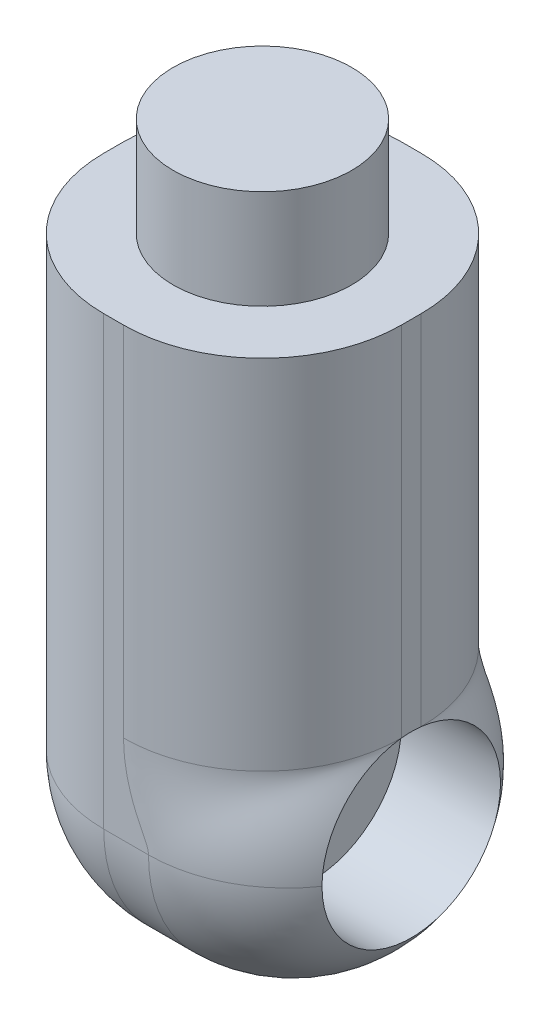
ISO-10303-21;
HEADER;
FILE_DESCRIPTION(('STEP AP214'),'2;1');
FILE_NAME('part.step','',(''),(''),'','','');
FILE_SCHEMA(('AUTOMOTIVE_DESIGN { 1 0 10303 214 1 1 1 1 }'));
ENDSEC;
DATA;
#1=APPLICATION_CONTEXT('core data for automotive mechanical design processes');
#2=APPLICATION_PROTOCOL_DEFINITION('international standard','automotive_design',2000,#1);
#3=PRODUCT_CONTEXT('',#1,'mechanical');
#4=PRODUCT('Part','Part','',(#3));
#5=PRODUCT_RELATED_PRODUCT_CATEGORY('part','',(#4));
#6=PRODUCT_DEFINITION_FORMATION('','',#4);
#7=PRODUCT_DEFINITION_CONTEXT('part definition',#1,'design');
#8=PRODUCT_DEFINITION('design','',#6,#7);
#9=PRODUCT_DEFINITION_SHAPE('','',#8);
#10=(LENGTH_UNIT() NAMED_UNIT(*) SI_UNIT(.MILLI.,.METRE.));
#11=(NAMED_UNIT(*) PLANE_ANGLE_UNIT() SI_UNIT($,.RADIAN.));
#12=(NAMED_UNIT(*) SI_UNIT($,.STERADIAN.) SOLID_ANGLE_UNIT());
#13=UNCERTAINTY_MEASURE_WITH_UNIT(LENGTH_MEASURE(1.E-05),#10,'distance_accuracy_value','');
#14=(GEOMETRIC_REPRESENTATION_CONTEXT(3) GLOBAL_UNCERTAINTY_ASSIGNED_CONTEXT((#13)) GLOBAL_UNIT_ASSIGNED_CONTEXT((#10,
#11,#12)) REPRESENTATION_CONTEXT('',''));
#15=CARTESIAN_POINT('',(0.,0.,0.));
#16=DIRECTION('',(0.,0.,1.));
#17=DIRECTION('',(1.,0.,0.));
#18=AXIS2_PLACEMENT_3D('',#15,#16,#17);
#19=CARTESIAN_POINT('',(150.,0.,0.));
#20=DIRECTION('',(-1.,0.,0.));
#21=DIRECTION('',(0.,0.,1.));
#22=AXIS2_PLACEMENT_3D('',#19,#20,#21);
#23=PLANE('',#22);
#24=CARTESIAN_POINT('',(150.,75.,-75.));
#25=DIRECTION('',(1.,0.,0.));
#26=DIRECTION('',(0.,0.,-1.));
#27=AXIS2_PLACEMENT_3D('',#24,#25,#26);
#28=CIRCLE('',#27,45.);
#29=CARTESIAN_POINT('',(150.,119.721359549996,-80.));
#30=VERTEX_POINT('',#29);
#31=CARTESIAN_POINT('',(150.,119.721359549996,-70.));
#32=VERTEX_POINT('',#31);
#33=EDGE_CURVE('E265',#30,#32,#28,.T.);
#34=ORIENTED_EDGE('',*,*,#33,.F.);
#35=DIRECTION('',(0.,1.,0.));
#36=VECTOR('',#35,1.);
#37=CARTESIAN_POINT('',(150.,0.,-80.));
#38=LINE('',#37,#36);
#39=CARTESIAN_POINT('',(150.,300.,-80.));
#40=VERTEX_POINT('',#39);
#41=EDGE_CURVE('E174',#30,#40,#38,.T.);
#42=ORIENTED_EDGE('',*,*,#41,.T.);
#43=DIRECTION('',(0.,0.,1.));
#44=VECTOR('',#43,1.);
#45=CARTESIAN_POINT('',(150.,300.,0.));
#46=LINE('',#45,#44);
#47=CARTESIAN_POINT('',(150.,300.,-70.));
#48=VERTEX_POINT('',#47);
#49=EDGE_CURVE('E250',#40,#48,#46,.T.);
#50=ORIENTED_EDGE('',*,*,#49,.T.);
#51=DIRECTION('',(0.,-1.,0.));
#52=VECTOR('',#51,1.);
#53=CARTESIAN_POINT('',(150.,0.,-70.));
#54=LINE('',#53,#52);
#55=EDGE_CURVE('E130',#48,#32,#54,.T.);
#56=ORIENTED_EDGE('',*,*,#55,.T.);
#57=EDGE_LOOP('',(#34,#42,#50,#56));
#58=FACE_BOUND('',#57,.T.);
#59=ADVANCED_FACE('F35',(#58),#23,.F.);
#60=CARTESIAN_POINT('',(0.,0.,0.));
#61=DIRECTION('',(-1.,0.,0.));
#62=DIRECTION('',(0.,0.,1.));
#63=AXIS2_PLACEMENT_3D('',#60,#61,#62);
#64=PLANE('',#63);
#65=DIRECTION('',(0.,0.,1.));
#66=VECTOR('',#65,1.);
#67=CARTESIAN_POINT('',(0.,300.,0.));
#68=LINE('',#67,#66);
#69=CARTESIAN_POINT('',(0.,300.,-80.));
#70=VERTEX_POINT('',#69);
#71=CARTESIAN_POINT('',(0.,300.,-70.));
#72=VERTEX_POINT('',#71);
#73=EDGE_CURVE('E251',#70,#72,#68,.T.);
#74=ORIENTED_EDGE('',*,*,#73,.F.);
#75=DIRECTION('',(0.,1.,0.));
#76=VECTOR('',#75,1.);
#77=CARTESIAN_POINT('',(0.,75.,-80.));
#78=LINE('',#77,#76);
#79=CARTESIAN_POINT('',(0.,75.,-80.));
#80=VERTEX_POINT('',#79);
#81=EDGE_CURVE('E170',#70,#80,#78,.F.);
#82=ORIENTED_EDGE('',*,*,#81,.T.);
#83=CARTESIAN_POINT('',(0.,75.,-75.));
#84=DIRECTION('',(-1.,0.,0.));
#85=DIRECTION('',(0.,0.,1.));
#86=AXIS2_PLACEMENT_3D('',#83,#84,#85);
#87=CIRCLE('',#86,5.00000000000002);
#88=CARTESIAN_POINT('',(0.,75.,-70.));
#89=VERTEX_POINT('',#88);
#90=EDGE_CURVE('E148',#80,#89,#87,.T.);
#91=ORIENTED_EDGE('',*,*,#90,.T.);
#92=DIRECTION('',(0.,-1.,0.));
#93=VECTOR('',#92,1.);
#94=CARTESIAN_POINT('',(0.,300.,-70.));
#95=LINE('',#94,#93);
#96=EDGE_CURVE('E167',#89,#72,#95,.F.);
#97=ORIENTED_EDGE('',*,*,#96,.T.);
#98=EDGE_LOOP('',(#74,#82,#91,#97));
#99=FACE_BOUND('',#98,.T.);
#100=ADVANCED_FACE('F291',(#99),#64,.T.);
#101=CARTESIAN_POINT('',(150.,0.,0.));
#102=DIRECTION('',(0.,0.,-1.));
#103=DIRECTION('',(-1.,0.,0.));
#104=AXIS2_PLACEMENT_3D('',#101,#102,#103);
#105=PLANE('',#104);
#106=DIRECTION('',(-1.,0.,0.));
#107=VECTOR('',#106,1.);
#108=CARTESIAN_POINT('',(150.,300.,0.));
#109=LINE('',#108,#107);
#110=CARTESIAN_POINT('',(80.,300.,0.));
#111=VERTEX_POINT('',#110);
#112=CARTESIAN_POINT('',(70.,300.,0.));
#113=VERTEX_POINT('',#112);
#114=EDGE_CURVE('E247',#111,#113,#109,.T.);
#115=ORIENTED_EDGE('',*,*,#114,.T.);
#116=DIRECTION('',(0.,-1.,0.));
#117=VECTOR('',#116,1.);
#118=CARTESIAN_POINT('',(70.,75.,0.));
#119=LINE('',#118,#117);
#120=CARTESIAN_POINT('',(70.,75.,0.));
#121=VERTEX_POINT('',#120);
#122=EDGE_CURVE('E11',#113,#121,#119,.T.);
#123=ORIENTED_EDGE('',*,*,#122,.T.);
#124=DIRECTION('',(1.,0.,0.));
#125=VECTOR('',#124,1.);
#126=CARTESIAN_POINT('',(0.,75.,0.));
#127=LINE('',#126,#125);
#128=CARTESIAN_POINT('',(92.5543735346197,75.,0.));
#129=VERTEX_POINT('',#128);
#130=EDGE_CURVE('E125',#121,#129,#127,.T.);
#131=ORIENTED_EDGE('',*,*,#130,.T.);
#132=CARTESIAN_POINT('',(150.,40.9334690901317,-45.598104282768));
#133=CARTESIAN_POINT('',(134.696267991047,48.2418132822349,0.));
#134=CARTESIAN_POINT('',(90.7955295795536,69.2067456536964,0.));
#135=CARTESIAN_POINT('',(150.,41.1227693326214,-45.3788000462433));
#136=CARTESIAN_POINT('',(134.603697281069,48.4501311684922,0.));
#137=CARTESIAN_POINT('',(90.8315374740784,69.282148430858,0.));
#138=CARTESIAN_POINT('',(150.,41.3185736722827,-45.1561854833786));
#139=CARTESIAN_POINT('',(134.510343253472,48.6633274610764,0.));
#140=CARTESIAN_POINT('',(90.8673965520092,69.3576225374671,0.));
#141=CARTESIAN_POINT('',(150.,41.724348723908,-44.7043951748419));
#142=CARTESIAN_POINT('',(134.322380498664,49.0996150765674,0.));
#143=CARTESIAN_POINT('',(90.9387682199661,69.5087352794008,0.));
#144=CARTESIAN_POINT('',(150.,41.9343195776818,-44.4752193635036));
#145=CARTESIAN_POINT('',(134.227780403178,49.3226698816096,0.));
#146=CARTESIAN_POINT('',(90.9742808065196,69.584373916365,0.));
#147=CARTESIAN_POINT('',(150.,42.3696113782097,-44.0103391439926));
#148=CARTESIAN_POINT('',(134.03742738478,49.7792432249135,0.));
#149=CARTESIAN_POINT('',(91.0449146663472,69.7358462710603,0.));
#150=CARTESIAN_POINT('',(150.,42.5949343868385,-43.7746338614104));
#151=CARTESIAN_POINT('',(133.94168264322,50.0127245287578,0.));
#152=CARTESIAN_POINT('',(91.0800358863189,69.8116800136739,0.));
#153=CARTESIAN_POINT('',(150.,43.0621793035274,-43.2968910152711));
#154=CARTESIAN_POINT('',(133.749204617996,50.4906966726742,0.));
#155=CARTESIAN_POINT('',(91.1498258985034,69.9635550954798,0.));
#156=CARTESIAN_POINT('',(150.,43.3041011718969,-43.0548534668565));
#157=CARTESIAN_POINT('',(133.652479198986,50.7351468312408,0.));
#158=CARTESIAN_POINT('',(91.1844946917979,70.0395964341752,0.));
#159=CARTESIAN_POINT('',(150.,44.0585708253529,-42.3178211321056));
#160=CARTESIAN_POINT('',(133.360748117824,51.4867354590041,0.));
#161=CARTESIAN_POINT('',(91.2879798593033,70.2686151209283,0.));
#162=CARTESIAN_POINT('',(150.,44.5982810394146,-41.8135766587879));
#163=CARTESIAN_POINT('',(133.16417524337,52.0121353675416,0.));
#164=CARTESIAN_POINT('',(91.3560208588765,70.4219442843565,0.));
#165=CARTESIAN_POINT('',(150.,45.7619151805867,-40.7839470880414));
#166=CARTESIAN_POINT('',(132.769605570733,53.1147946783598,0.));
#167=CARTESIAN_POINT('',(91.4894660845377,70.7297452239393,0.));
#168=CARTESIAN_POINT('',(150.,46.3858361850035,-40.2585627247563));
#169=CARTESIAN_POINT('',(132.57165031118,53.6916879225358,0.));
#170=CARTESIAN_POINT('',(91.5548704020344,70.8842169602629,0.));
#171=CARTESIAN_POINT('',(150.,47.40422410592,-39.4519070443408));
#172=CARTESIAN_POINT('',(132.272539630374,54.6093957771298,0.));
#173=CARTESIAN_POINT('',(91.6513689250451,71.1191448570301,0.));
#174=CARTESIAN_POINT('',(150.,47.7628840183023,-39.1760579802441));
#175=CARTESIAN_POINT('',(132.17128527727,54.928042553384,0.));
#176=CARTESIAN_POINT('',(91.6836931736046,71.1990962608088,0.));
#177=CARTESIAN_POINT('',(150.,48.5077776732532,-38.6217384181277));
#178=CARTESIAN_POINT('',(131.969608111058,55.5809604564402,0.));
#179=CARTESIAN_POINT('',(91.7473453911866,71.3593942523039,0.));
#180=CARTESIAN_POINT('',(150.,48.8940110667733,-38.3432679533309));
#181=CARTESIAN_POINT('',(131.869184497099,55.9151838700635,0.));
#182=CARTESIAN_POINT('',(91.7786733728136,71.4397408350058,0.));
#183=CARTESIAN_POINT('',(150.,49.6958998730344,-37.7852034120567));
#184=CARTESIAN_POINT('',(131.66969737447,56.5998835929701,0.));
#185=CARTESIAN_POINT('',(91.8402142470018,71.600867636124,0.));
#186=CARTESIAN_POINT('',(150.,50.1115575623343,-37.5056092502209));
#187=CARTESIAN_POINT('',(131.5706301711,56.9503170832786,0.));
#188=CARTESIAN_POINT('',(91.8704270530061,71.6816478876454,0.));
#189=CARTESIAN_POINT('',(150.,50.9740006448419,-36.9472042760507));
#190=CARTESIAN_POINT('',(131.374489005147,57.6679300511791,0.));
#191=CARTESIAN_POINT('',(91.9296005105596,71.8436646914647,0.));
#192=CARTESIAN_POINT('',(150.,51.4207854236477,-36.6683934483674));
#193=CARTESIAN_POINT('',(131.277407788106,58.0350704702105,0.));
#194=CARTESIAN_POINT('',(91.9585611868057,71.9249012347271,0.));
#195=CARTESIAN_POINT('',(150.,52.3465305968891,-36.1141283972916));
#196=CARTESIAN_POINT('',(131.0860561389,58.7860806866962,0.));
#197=CARTESIAN_POINT('',(92.0150519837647,72.0877646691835,0.));
#198=CARTESIAN_POINT('',(150.,52.8254527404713,-35.8386706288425));
#199=CARTESIAN_POINT('',(130.991771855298,59.1698985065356,0.));
#200=CARTESIAN_POINT('',(92.0425837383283,72.1693909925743,0.));
#201=CARTESIAN_POINT('',(150.,53.8172605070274,-35.2934291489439));
#202=CARTESIAN_POINT('',(130.806688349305,59.9549289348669,0.));
#203=CARTESIAN_POINT('',(92.0960957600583,72.3331522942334,0.));
#204=CARTESIAN_POINT('',(150.,54.3301463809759,-35.0236454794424));
#205=CARTESIAN_POINT('',(130.715874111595,60.3561216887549,0.));
#206=CARTESIAN_POINT('',(92.1220760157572,72.4152872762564,0.));
#207=CARTESIAN_POINT('',(150.,55.3907657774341,-34.4928463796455));
#208=CARTESIAN_POINT('',(130.538618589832,61.1759265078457,0.));
#209=CARTESIAN_POINT('',(92.1723134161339,72.5800740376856,0.));
#210=CARTESIAN_POINT('',(150.,55.9384954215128,-34.2318299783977));
#211=CARTESIAN_POINT('',(130.452157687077,61.5945304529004,0.));
#212=CARTESIAN_POINT('',(92.1965707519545,72.6627257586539,0.));
#213=CARTESIAN_POINT('',(150.,57.0692430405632,-33.722008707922));
#214=CARTESIAN_POINT('',(130.28455584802,62.4489991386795,0.));
#215=CARTESIAN_POINT('',(92.2431863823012,72.8285609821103,0.));
#216=CARTESIAN_POINT('',(150.,57.6522600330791,-33.4732034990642));
#217=CARTESIAN_POINT('',(130.203391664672,62.884874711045,0.));
#218=CARTESIAN_POINT('',(92.2655447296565,72.9117444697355,0.));
#219=CARTESIAN_POINT('',(150.,59.0604612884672,-32.9085767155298));
#220=CARTESIAN_POINT('',(130.020572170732,63.9262263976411,0.));
#221=CARTESIAN_POINT('',(92.3155280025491,73.1074187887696,0.));
#222=CARTESIAN_POINT('',(150.,59.8998391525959,-32.5992227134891));
#223=CARTESIAN_POINT('',(129.921347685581,64.5389795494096,0.));
#224=CARTESIAN_POINT('',(92.3423112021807,73.2201266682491,0.));
#225=CARTESIAN_POINT('',(150.,61.6390885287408,-32.0194715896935));
#226=CARTESIAN_POINT('',(129.736938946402,65.7926923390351,0.));
#227=CARTESIAN_POINT('',(92.3916520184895,73.4464653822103,0.));
#228=CARTESIAN_POINT('',(150.,62.538958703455,-31.7490736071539));
#229=CARTESIAN_POINT('',(129.65168243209,66.4338085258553,0.));
#230=CARTESIAN_POINT('',(92.4142097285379,73.56009619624,0.));
#231=CARTESIAN_POINT('',(150.,64.3927702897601,-31.2575078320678));
#232=CARTESIAN_POINT('',(129.497761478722,67.7406212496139,0.));
#233=CARTESIAN_POINT('',(92.4546555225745,73.7881778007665,0.));
#234=CARTESIAN_POINT('',(150.,65.3467053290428,-31.0363342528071));
#235=CARTESIAN_POINT('',(129.429022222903,68.4065596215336,0.));
#236=CARTESIAN_POINT('',(92.4725441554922,73.9026284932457,0.));
#237=CARTESIAN_POINT('',(150.,67.2987834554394,-30.6527324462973));
#238=CARTESIAN_POINT('',(129.310426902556,69.7580995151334,0.));
#239=CARTESIAN_POINT('',(92.5032601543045,74.1322115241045,0.));
#240=CARTESIAN_POINT('',(150.,68.2969263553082,-30.4903039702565));
#241=CARTESIAN_POINT('',(129.260505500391,70.444032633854,0.));
#242=CARTESIAN_POINT('',(92.516087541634,74.2473438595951,0.));
#243=CARTESIAN_POINT('',(150.,70.3114394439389,-30.2335467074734));
#244=CARTESIAN_POINT('',(129.181858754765,71.8206898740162,0.));
#245=CARTESIAN_POINT('',(92.5362451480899,74.4766564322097,0.));
#246=CARTESIAN_POINT('',(150.,71.3274313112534,-30.1384002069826));
#247=CARTESIAN_POINT('',(129.152832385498,72.5116326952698,0.));
#248=CARTESIAN_POINT('',(92.5436414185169,74.5908308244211,0.));
#249=CARTESIAN_POINT('',(150.,73.3738729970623,-30.0177139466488));
#250=CARTESIAN_POINT('',(129.116065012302,73.8995004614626,0.));
#251=CARTESIAN_POINT('',(92.5530083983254,74.8194021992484,0.));
#252=CARTESIAN_POINT('',(150.,74.40432258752,-29.9921730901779));
#253=CARTESIAN_POINT('',(129.108300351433,74.5968614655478,0.));
#254=CARTESIAN_POINT('',(92.5549791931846,74.9337991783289,0.));
#255=CARTESIAN_POINT('',(150.,76.4628221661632,-30.012004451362));
#256=CARTESIAN_POINT('',(129.11433330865,75.9900678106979,0.));
#257=CARTESIAN_POINT('',(92.5534446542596,75.1625547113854,0.));
#258=CARTESIAN_POINT('',(150.,77.4908721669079,-30.0573762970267));
#259=CARTESIAN_POINT('',(129.1281347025,76.6863621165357,0.));
#260=CARTESIAN_POINT('',(92.5499393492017,75.2769132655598,0.));
#261=CARTESIAN_POINT('',(150.,79.527995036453,-30.2167327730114));
#262=CARTESIAN_POINT('',(129.176737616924,78.0700995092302,0.));
#263=CARTESIAN_POINT('',(92.5375417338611,75.5053433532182,0.));
#264=CARTESIAN_POINT('',(150.,80.5370671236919,-30.3307202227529));
#265=CARTESIAN_POINT('',(129.211570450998,78.7579687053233,0.));
#266=CARTESIAN_POINT('',(92.5286492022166,75.6194148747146,0.));
#267=CARTESIAN_POINT('',(150.,82.1706022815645,-30.5702365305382));
#268=CARTESIAN_POINT('',(129.285080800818,79.87746949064,0.));
#269=CARTESIAN_POINT('',(92.509756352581,75.8068026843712,0.));
#270=CARTESIAN_POINT('',(150.,82.8049571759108,-30.6774493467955));
#271=CARTESIAN_POINT('',(129.318077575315,80.3140415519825,0.));
#272=CARTESIAN_POINT('',(92.5012582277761,75.8802747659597,0.));
#273=CARTESIAN_POINT('',(150.,84.0561571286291,-30.9160869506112));
#274=CARTESIAN_POINT('',(129.391786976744,81.179199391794,0.));
#275=CARTESIAN_POINT('',(92.4821878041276,76.0269516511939,0.));
#276=CARTESIAN_POINT('',(150.,84.6730017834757,-31.0475122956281));
#277=CARTESIAN_POINT('',(129.432516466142,81.6078730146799,0.));
#278=CARTESIAN_POINT('',(92.4716154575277,76.1001564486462,0.));
#279=CARTESIAN_POINT('',(150.,85.8863513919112,-31.3322103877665));
#280=CARTESIAN_POINT('',(129.521122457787,82.4558878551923,0.));
#281=CARTESIAN_POINT('',(92.4484930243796,76.2462585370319,0.));
#282=CARTESIAN_POINT('',(150.,86.4828545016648,-31.4854851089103));
#283=CARTESIAN_POINT('',(129.569017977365,82.8753022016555,0.));
#284=CARTESIAN_POINT('',(92.4359427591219,76.3191557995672,0.));
#285=CARTESIAN_POINT('',(150.,87.6532294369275,-31.8112885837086));
#286=CARTESIAN_POINT('',(129.671322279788,83.7036385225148,0.));
#287=CARTESIAN_POINT('',(92.4089736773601,76.4646026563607,0.));
#288=CARTESIAN_POINT('',(150.,88.2271013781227,-31.9838172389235));
#289=CARTESIAN_POINT('',(129.725750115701,84.1126198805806,0.));
#290=CARTESIAN_POINT('',(92.3945548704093,76.5371522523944,0.));
#291=CARTESIAN_POINT('',(150.,89.3510006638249,-32.3456026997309));
#292=CARTESIAN_POINT('',(129.840502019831,84.9195095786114,0.));
#293=CARTESIAN_POINT('',(92.3639522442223,76.6819343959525,0.));
#294=CARTESIAN_POINT('',(150.,89.90100971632,-32.5348720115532));
#295=CARTESIAN_POINT('',(129.900849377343,85.3174536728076,0.));
#296=CARTESIAN_POINT('',(92.3477671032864,76.7541666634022,0.));
#297=CARTESIAN_POINT('',(150.,90.9756496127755,-32.9273736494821));
#298=CARTESIAN_POINT('',(130.026734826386,86.1012874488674,0.));
#299=CARTESIAN_POINT('',(92.3137594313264,76.8982439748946,0.));
#300=CARTESIAN_POINT('',(150.,91.5002804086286,-33.1306060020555));
#301=CARTESIAN_POINT('',(130.092290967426,86.487208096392,0.));
#302=CARTESIAN_POINT('',(92.2959368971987,76.9700890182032,0.));
#303=CARTESIAN_POINT('',(150.,92.5235739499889,-33.5484642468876));
#304=CARTESIAN_POINT('',(130.227929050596,87.246525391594,0.));
#305=CARTESIAN_POINT('',(92.2587744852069,77.1133813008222,0.));
#306=CARTESIAN_POINT('',(150.,93.0222378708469,-33.7630896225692));
#307=CARTESIAN_POINT('',(130.298027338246,87.6199409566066,0.));
#308=CARTESIAN_POINT('',(92.2394346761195,77.1848285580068,0.));
#309=CARTESIAN_POINT('',(150.,93.9935127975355,-34.2013436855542));
#310=CARTESIAN_POINT('',(130.442116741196,88.3540121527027,0.));
#311=CARTESIAN_POINT('',(92.1993536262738,77.3273302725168,0.));
#312=CARTESIAN_POINT('',(150.,94.4661230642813,-34.4249726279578));
#313=CARTESIAN_POINT('',(130.516122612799,88.7146745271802,0.));
#314=CARTESIAN_POINT('',(92.1786123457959,77.3983847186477,0.));
#315=CARTESIAN_POINT('',(150.,95.3906040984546,-34.8815249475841));
#316=CARTESIAN_POINT('',(130.668259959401,89.4270521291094,0.));
#317=CARTESIAN_POINT('',(92.1356056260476,77.5408886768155,0.));
#318=CARTESIAN_POINT('',(150.,95.8421874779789,-35.1145237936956));
#319=CARTESIAN_POINT('',(130.746439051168,89.7786130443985,0.));
#320=CARTESIAN_POINT('',(92.1133258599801,77.612333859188,0.));
#321=CARTESIAN_POINT('',(150.,96.7195215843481,-35.5854073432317));
#322=CARTESIAN_POINT('',(130.905580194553,90.4686158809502,0.));
#323=CARTESIAN_POINT('',(92.0675615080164,77.7548379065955,0.));
#324=CARTESIAN_POINT('',(150.,97.1452717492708,-35.823292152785));
#325=CARTESIAN_POINT('',(130.986552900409,90.8070466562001,0.));
#326=CARTESIAN_POINT('',(92.0440768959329,77.8258967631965,0.));
#327=CARTESIAN_POINT('',(150.,98.384890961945,-36.5414489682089));
#328=CARTESIAN_POINT('',(131.233105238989,91.80397834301,0.));
#329=CARTESIAN_POINT('',(91.9719777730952,78.0385106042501,0.));
#330=CARTESIAN_POINT('',(150.,99.1611668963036,-37.0262425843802));
#331=CARTESIAN_POINT('',(131.401807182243,92.4417451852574,0.));
#332=CARTESIAN_POINT('',(91.9217161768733,78.1795087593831,0.));
#333=CARTESIAN_POINT('',(150.,100.621348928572,-37.9957531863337));
#334=CARTESIAN_POINT('',(131.744375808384,93.6673747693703,0.));
#335=CARTESIAN_POINT('',(91.8175889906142,78.4601072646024,0.));
#336=CARTESIAN_POINT('',(150.,101.305283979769,-38.4804701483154));
#337=CARTESIAN_POINT('',(131.918271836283,94.2550392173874,0.));
#338=CARTESIAN_POINT('',(91.7637245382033,78.5997080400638,0.));
#339=CARTESIAN_POINT('',(150.,102.590555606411,-39.4415271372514));
#340=CARTESIAN_POINT('',(132.268395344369,95.3838325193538,0.));
#341=CARTESIAN_POINT('',(91.653030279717,78.8777244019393,0.));
#342=CARTESIAN_POINT('',(150.,103.191892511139,-39.917867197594));
#343=CARTESIAN_POINT('',(132.444625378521,95.9247115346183,0.));
#344=CARTESIAN_POINT('',(91.5962004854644,79.0161399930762,0.));
#345=CARTESIAN_POINT('',(150.,104.38034187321,-40.9052309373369));
#346=CARTESIAN_POINT('',(132.815624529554,97.0177617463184,0.));
#347=CARTESIAN_POINT('',(91.4740860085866,79.3063142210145,0.));
#348=CARTESIAN_POINT('',(150.,104.959452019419,-41.4147008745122));
#349=CARTESIAN_POINT('',(133.010288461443,97.5646131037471,0.));
#350=CARTESIAN_POINT('',(91.4085371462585,79.4579613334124,0.));
#351=CARTESIAN_POINT('',(150.,106.040798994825,-42.4115174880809));
#352=CARTESIAN_POINT('',(133.397507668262,98.6106557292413,0.));
#353=CARTESIAN_POINT('',(91.2751193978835,79.7602289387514,0.));
#354=CARTESIAN_POINT('',(150.,106.543035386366,-42.8988640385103));
#355=CARTESIAN_POINT('',(133.590015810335,99.1095051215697,0.));
#356=CARTESIAN_POINT('',(91.2072504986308,79.910849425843,0.));
#357=CARTESIAN_POINT('',(150.,107.481576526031,-43.8488706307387));
#358=CARTESIAN_POINT('',(133.971358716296,100.064170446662,0.));
#359=CARTESIAN_POINT('',(91.0697013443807,80.2112563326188,0.));
#360=CARTESIAN_POINT('',(150.,107.917882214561,-44.3115310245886));
#361=CARTESIAN_POINT('',(134.16013342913,100.519669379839,0.));
#362=CARTESIAN_POINT('',(91.0000211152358,80.3610427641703,0.));
#363=CARTESIAN_POINT('',(150.,108.734160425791,-45.2111574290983));
#364=CARTESIAN_POINT('',(134.532946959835,101.39196613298,0.));
#365=CARTESIAN_POINT('',(90.8592658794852,80.6599568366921,0.));
#366=CARTESIAN_POINT('',(150.,109.114133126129,-45.648123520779));
#367=CARTESIAN_POINT('',(134.71691906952,101.808476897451,0.));
#368=CARTESIAN_POINT('',(90.7881908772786,80.8090844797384,0.));
#369=CARTESIAN_POINT('',(150.,109.824119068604,-46.494142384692));
#370=CARTESIAN_POINT('',(135.078477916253,102.604631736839,0.));
#371=CARTESIAN_POINT('',(90.6453677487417,81.1060471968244,0.));
#372=CARTESIAN_POINT('',(150.,110.154385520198,-46.9033303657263));
#373=CARTESIAN_POINT('',(135.256029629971,102.984216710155,0.));
#374=CARTESIAN_POINT('',(90.5736251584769,81.2538849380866,0.));
#375=CARTESIAN_POINT('',(150.,110.774261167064,-47.6969667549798));
#376=CARTESIAN_POINT('',(135.605360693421,103.712504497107,0.));
#377=CARTESIAN_POINT('',(90.4293802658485,81.5491885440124,0.));
#378=CARTESIAN_POINT('',(150.,111.063870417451,-48.0814151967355));
#379=CARTESIAN_POINT('',(135.777073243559,104.06098704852,0.));
#380=CARTESIAN_POINT('',(90.3568779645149,81.6966544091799,0.));
#381=CARTESIAN_POINT('',(150.,111.608302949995,-48.8266342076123));
#382=CARTESIAN_POINT('',(136.114523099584,104.730213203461,0.));
#383=CARTESIAN_POINT('',(90.2113460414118,81.9913289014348,0.));
#384=CARTESIAN_POINT('',(150.,111.863125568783,-49.1874043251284));
#385=CARTESIAN_POINT('',(136.280196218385,105.050764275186,0.));
#386=CARTESIAN_POINT('',(90.1383164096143,82.1385375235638,0.));
#387=CARTESIAN_POINT('',(150.,112.222965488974,-49.7117500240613));
#388=CARTESIAN_POINT('',(136.523940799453,105.51241821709,0.));
#389=CARTESIAN_POINT('',(90.0285238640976,82.359227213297,0.));
#390=CARTESIAN_POINT('',(150.,112.339179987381,-49.8837306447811));
#391=CARTESIAN_POINT('',(136.604501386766,105.663299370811,0.));
#392=CARTESIAN_POINT('',(89.9918849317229,82.4327700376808,0.));
#393=CARTESIAN_POINT('',(150.,112.564676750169,-50.2222592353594));
#394=CARTESIAN_POINT('',(136.764108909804,105.959111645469,0.));
#395=CARTESIAN_POINT('',(89.9185454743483,82.5798249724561,0.));
#396=CARTESIAN_POINT('',(150.,112.673959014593,-50.3888072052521));
#397=CARTESIAN_POINT('',(136.84314858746,106.104023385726,0.));
#398=CARTESIAN_POINT('',(89.8818449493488,82.6533370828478,0.));
#399=CARTESIAN_POINT('',(150.,112.992984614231,-50.8818116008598));
#400=CARTESIAN_POINT('',(137.078822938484,106.531775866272,0.));
#401=CARTESIAN_POINT('',(89.771401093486,82.8744034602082,0.));
#402=CARTESIAN_POINT('',(150.,113.192998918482,-51.2002968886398));
#403=CARTESIAN_POINT('',(137.232914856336,106.80556421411,0.));
#404=CARTESIAN_POINT('',(89.697595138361,83.021926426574,0.));
#405=CARTESIAN_POINT('',(150.,113.570731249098,-51.8174752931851));
#406=CARTESIAN_POINT('',(137.53516644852,107.332702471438,0.));
#407=CARTESIAN_POINT('',(89.5499592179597,83.3169603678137,0.));
#408=CARTESIAN_POINT('',(150.,113.748449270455,-52.1161684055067));
#409=CARTESIAN_POINT('',(137.683274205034,107.585926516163,0.));
#410=CARTESIAN_POINT('',(89.476129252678,83.4644713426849,0.));
#411=CARTESIAN_POINT('',(150.,114.084596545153,-52.6951496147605));
#412=CARTESIAN_POINT('',(137.973720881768,108.073897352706,0.));
#413=CARTESIAN_POINT('',(89.3285662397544,83.7595419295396,0.));
#414=CARTESIAN_POINT('',(150.,114.243025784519,-52.9754376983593));
#415=CARTESIAN_POINT('',(138.116012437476,108.308535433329,0.));
#416=CARTESIAN_POINT('',(89.2548331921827,83.9071015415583,0.));
#417=CARTESIAN_POINT('',(150.,114.543145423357,-53.5189393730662));
#418=CARTESIAN_POINT('',(138.395021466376,108.761074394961,0.));
#419=CARTESIAN_POINT('',(89.1075681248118,84.2023210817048,0.));
#420=CARTESIAN_POINT('',(150.,114.684835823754,-53.7821529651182));
#421=CARTESIAN_POINT('',(138.53169593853,108.978881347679,0.));
#422=CARTESIAN_POINT('',(89.0340361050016,84.3499810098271,0.));
#423=CARTESIAN_POINT('',(150.,114.953643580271,-54.2927638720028));
#424=CARTESIAN_POINT('',(138.799684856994,109.39930277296,0.));
#425=CARTESIAN_POINT('',(88.8872635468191,84.6454444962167,0.));
#426=CARTESIAN_POINT('',(150.,115.08076103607,-54.5401612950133));
#427=CARTESIAN_POINT('',(138.930960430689,109.601836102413,0.));
#428=CARTESIAN_POINT('',(88.8140230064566,84.7932480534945,0.));
#429=CARTESIAN_POINT('',(150.,115.322254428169,-55.0203146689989));
#430=CARTESIAN_POINT('',(139.188376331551,109.993074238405,0.));
#431=CARTESIAN_POINT('',(88.6679105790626,85.0890372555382,0.));
#432=CARTESIAN_POINT('',(150.,115.43663036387,-55.2530706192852));
#433=CARTESIAN_POINT('',(139.314481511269,110.181708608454,0.));
#434=CARTESIAN_POINT('',(88.5950386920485,85.2370229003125,0.));
#435=CARTESIAN_POINT('',(150.,115.763068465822,-55.931042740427));
#436=CARTESIAN_POINT('',(139.685941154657,110.729485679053,0.));
#437=CARTESIAN_POINT('',(88.3770806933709,85.6813026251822,0.));
#438=CARTESIAN_POINT('',(150.,115.958441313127,-56.3559639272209));
#439=CARTESIAN_POINT('',(139.923257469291,111.06867397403,0.));
#440=CARTESIAN_POINT('',(88.2326520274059,85.9779199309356,0.));
#441=CARTESIAN_POINT('',(150.,116.314717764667,-57.1594188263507));
#442=CARTESIAN_POINT('',(140.380166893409,111.705188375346,0.));
#443=CARTESIAN_POINT('',(87.9460223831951,86.5721752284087,0.));
#444=CARTESIAN_POINT('',(150.,116.475626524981,-57.5379594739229));
#445=CARTESIAN_POINT('',(140.599557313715,112.002151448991,0.));
#446=CARTESIAN_POINT('',(87.8038210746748,86.8698130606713,0.));
#447=CARTESIAN_POINT('',(150.,116.77037185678,-58.2552611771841));
#448=CARTESIAN_POINT('',(141.022338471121,112.560781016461,0.));
#449=CARTESIAN_POINT('',(87.5219754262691,87.466298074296,0.));
#450=CARTESIAN_POINT('',(150.,116.904208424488,-58.5940222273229));
#451=CARTESIAN_POINT('',(141.225562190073,112.822164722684,0.));
#452=CARTESIAN_POINT('',(87.3823310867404,87.7651452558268,0.));
#453=CARTESIAN_POINT('',(150.,117.150381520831,-59.2372676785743));
#454=CARTESIAN_POINT('',(141.617562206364,113.314927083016,0.));
#455=CARTESIAN_POINT('',(87.105879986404,88.3641554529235,0.));
#456=CARTESIAN_POINT('',(150.,117.262717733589,-59.5417515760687));
#457=CARTESIAN_POINT('',(141.806202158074,113.546087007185,0.));
#458=CARTESIAN_POINT('',(86.9690732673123,88.6643184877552,0.));
#459=CARTESIAN_POINT('',(150.,117.470123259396,-60.1210491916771));
#460=CARTESIAN_POINT('',(142.170431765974,113.982703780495,0.));
#461=CARTESIAN_POINT('',(86.6985292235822,89.2660254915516,0.));
#462=CARTESIAN_POINT('',(150.,117.565192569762,-60.3958629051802));
#463=CARTESIAN_POINT('',(142.34591001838,114.18799061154,0.));
#464=CARTESIAN_POINT('',(86.5647918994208,89.567569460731,0.));
#465=CARTESIAN_POINT('',(150.,117.741413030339,-60.9199421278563));
#466=CARTESIAN_POINT('',(142.685229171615,114.576585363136,0.));
#467=CARTESIAN_POINT('',(86.3004534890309,90.1723642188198,0.));
#468=CARTESIAN_POINT('',(150.,117.822551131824,-61.1691835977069));
#469=CARTESIAN_POINT('',(142.848966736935,114.759738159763,0.));
#470=CARTESIAN_POINT('',(86.1698554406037,90.4756163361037,0.));
#471=CARTESIAN_POINT('',(150.,117.973352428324,-61.6451044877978));
#472=CARTESIAN_POINT('',(143.16574461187,115.106784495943,0.));
#473=CARTESIAN_POINT('',(85.9120842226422,91.0835732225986,0.));
#474=CARTESIAN_POINT('',(150.,118.043015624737,-61.8717839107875));
#475=CARTESIAN_POINT('',(143.318709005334,115.270571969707,0.));
#476=CARTESIAN_POINT('',(85.7849110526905,91.3882779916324,0.));
#477=CARTESIAN_POINT('',(150.,118.172874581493,-62.3053526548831));
#478=CARTESIAN_POINT('',(143.614934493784,115.581341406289,0.));
#479=CARTESIAN_POINT('',(85.5341261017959,91.999146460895,0.));
#480=CARTESIAN_POINT('',(150.,118.233070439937,-62.5122421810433));
#481=CARTESIAN_POINT('',(143.7581326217,115.728238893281,0.));
#482=CARTESIAN_POINT('',(85.4105142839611,92.3053101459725,0.));
#483=CARTESIAN_POINT('',(150.,118.345590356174,-62.9085899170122));
#484=CARTESIAN_POINT('',(144.035710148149,116.007291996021,0.));
#485=CARTESIAN_POINT('',(85.1669665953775,92.91909661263,0.));
#486=CARTESIAN_POINT('',(150.,118.397914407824,-63.098048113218));
#487=CARTESIAN_POINT('',(144.170036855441,116.139379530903,0.));
#488=CARTESIAN_POINT('',(85.0470307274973,93.2267193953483,0.));
#489=CARTESIAN_POINT('',(150.,118.495988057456,-63.4616081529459));
#490=CARTESIAN_POINT('',(144.430700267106,116.390601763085,0.));
#491=CARTESIAN_POINT('',(84.8108960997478,93.8435144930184,0.));
#492=CARTESIAN_POINT('',(150.,118.541735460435,-63.6357048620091));
#493=CARTESIAN_POINT('',(144.556989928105,116.509676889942,0.));
#494=CARTESIAN_POINT('',(84.6946985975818,94.1526872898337,0.));
#495=CARTESIAN_POINT('',(150.,118.627662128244,-63.9701860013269));
#496=CARTESIAN_POINT('',(144.802221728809,116.736297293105,0.));
#497=CARTESIAN_POINT('',(84.4661700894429,94.7724590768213,0.));
#498=CARTESIAN_POINT('',(150.,118.667841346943,-64.1305703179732));
#499=CARTESIAN_POINT('',(144.921126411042,116.843797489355,0.));
#500=CARTESIAN_POINT('',(84.3538391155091,95.0830580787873,0.));
#501=CARTESIAN_POINT('',(150.,118.781337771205,-64.5934562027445));
#502=CARTESIAN_POINT('',(145.268140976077,117.151295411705,0.));
#503=CARTESIAN_POINT('',(84.022756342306,96.016980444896,0.));
#504=CARTESIAN_POINT('',(150.,118.847611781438,-64.8776832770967));
#505=CARTESIAN_POINT('',(145.485650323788,117.335440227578,0.));
#506=CARTESIAN_POINT('',(83.8099196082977,96.6424163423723,0.));
#507=CARTESIAN_POINT('',(150.,118.952871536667,-65.3465912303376));
#508=CARTESIAN_POINT('',(145.850889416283,117.632696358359,0.));
#509=CARTESIAN_POINT('',(83.4472724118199,97.7552455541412,0.));
#510=CARTESIAN_POINT('',(150.,118.994633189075,-65.5391869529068));
#511=CARTESIAN_POINT('',(146.003231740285,117.752414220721,0.));
#512=CARTESIAN_POINT('',(83.2941633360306,98.2415684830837,0.));
#513=CARTESIAN_POINT('',(150.,119.071601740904,-65.9044592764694));
#514=CARTESIAN_POINT('',(146.295991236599,117.975241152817,0.));
#515=CARTESIAN_POINT('',(82.9978513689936,99.2172351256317,0.));
#516=CARTESIAN_POINT('',(150.,119.106808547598,-66.0771355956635));
#517=CARTESIAN_POINT('',(146.436340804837,118.078280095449,0.));
#518=CARTESIAN_POINT('',(82.8546486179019,99.7065788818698,0.));
#519=CARTESIAN_POINT('',(150.,119.171945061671,-66.4053970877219));
#520=CARTESIAN_POINT('',(146.706444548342,118.270121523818,0.));
#521=CARTESIAN_POINT('',(82.5783187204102,100.688122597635,0.));
#522=CARTESIAN_POINT('',(150.,119.201874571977,-66.560981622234));
#523=CARTESIAN_POINT('',(146.836144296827,118.358870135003,0.));
#524=CARTESIAN_POINT('',(82.4451919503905,101.180322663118,0.));
#525=CARTESIAN_POINT('',(150.,119.257431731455,-66.8573680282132));
#526=CARTESIAN_POINT('',(147.086066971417,118.524060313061,0.));
#527=CARTESIAN_POINT('',(82.1891638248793,102.167386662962,0.));
#528=CARTESIAN_POINT('',(150.,119.283059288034,-66.9981695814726));
#529=CARTESIAN_POINT('',(147.206245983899,118.600460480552,0.));
#530=CARTESIAN_POINT('',(82.0662626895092,102.662250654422,0.));
#531=CARTESIAN_POINT('',(150.,119.330781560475,-67.266926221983));
#532=CARTESIAN_POINT('',(147.438097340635,118.742567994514,0.));
#533=CARTESIAN_POINT('',(81.830806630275,103.654482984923,0.));
#534=CARTESIAN_POINT('',(150.,119.352875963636,-67.3948801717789));
#535=CARTESIAN_POINT('',(147.549733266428,118.808242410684,0.));
#536=CARTESIAN_POINT('',(81.7182526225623,104.151851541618,0.));
#537=CARTESIAN_POINT('',(150.,119.39412988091,-67.639527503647));
#538=CARTESIAN_POINT('',(147.765306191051,118.930224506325,0.));
#539=CARTESIAN_POINT('',(81.5036138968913,105.14884563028,0.));
#540=CARTESIAN_POINT('',(150.,119.413289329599,-67.7562206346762));
#541=CARTESIAN_POINT('',(147.869213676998,118.986506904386,0.));
#542=CARTESIAN_POINT('',(81.4015294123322,105.648471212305,0.));
#543=CARTESIAN_POINT('',(150.,119.467113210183,-68.0914911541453));
#544=CARTESIAN_POINT('',(148.17071505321,119.14317283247,0.));
#545=CARTESIAN_POINT('',(81.1111393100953,107.150387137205,0.));
#546=CARTESIAN_POINT('',(150.,119.498126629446,-68.2952795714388));
#547=CARTESIAN_POINT('',(148.357494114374,119.231026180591,0.));
#548=CARTESIAN_POINT('',(80.9386791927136,108.15579181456,0.));
#549=CARTESIAN_POINT('',(150.,119.553661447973,-68.6747918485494));
#550=CARTESIAN_POINT('',(148.710555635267,119.382292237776,0.));
#551=CARTESIAN_POINT('',(80.6344139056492,110.188239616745,0.));
#552=CARTESIAN_POINT('',(150.,119.578077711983,-68.8500453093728));
#553=CARTESIAN_POINT('',(148.87633837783,119.445209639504,0.));
#554=CARTESIAN_POINT('',(80.5032621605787,111.21538019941,0.));
#555=CARTESIAN_POINT('',(150.,119.621725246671,-69.1751832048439));
#556=CARTESIAN_POINT('',(149.18768817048,119.550107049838,0.));
#557=CARTESIAN_POINT('',(80.2856917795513,113.274394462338,0.));
#558=CARTESIAN_POINT('',(150.,119.640956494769,-69.3250675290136));
#559=CARTESIAN_POINT('',(149.333154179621,119.592020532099,0.));
#560=CARTESIAN_POINT('',(80.1992733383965,114.306268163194,0.));
#561=CARTESIAN_POINT('',(150.,119.675577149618,-69.604394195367));
#562=CARTESIAN_POINT('',(149.606757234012,119.659035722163,0.));
#563=CARTESIAN_POINT('',(80.0715051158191,116.373217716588,0.));
#564=CARTESIAN_POINT('',(150.,119.69096514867,-69.7338290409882));
#565=CARTESIAN_POINT('',(149.734814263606,119.684088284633,0.));
#566=CARTESIAN_POINT('',(80.0301718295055,117.40829460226,0.));
#567=CARTESIAN_POINT('',(150.,119.711856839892,-69.9153636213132));
#568=CARTESIAN_POINT('',(149.915435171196,119.711392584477,0.));
#569=CARTESIAN_POINT('',(80.0021823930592,118.96146178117,0.));
#570=CARTESIAN_POINT('',(150.,119.718455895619,-69.9737741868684));
#571=CARTESIAN_POINT('',(149.973761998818,119.71878225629,0.));
#572=CARTESIAN_POINT('',(79.998521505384,119.479295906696,0.));
#573=CARTESIAN_POINT('',(150.,119.731010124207,-70.0867575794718));
#574=CARTESIAN_POINT('',(150.086841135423,119.730452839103,0.));
#575=CARTESIAN_POINT('',(80.0025514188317,120.514921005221,0.));
#576=CARTESIAN_POINT('',(150.,119.736965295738,-70.1413303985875));
#577=CARTESIAN_POINT('',(150.141587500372,119.734730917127,0.));
#578=CARTESIAN_POINT('',(80.0102422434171,121.03271197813,0.));
#579=CARTESIAN_POINT('',(150.,119.742641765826,-70.1941693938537));
#580=CARTESIAN_POINT('',(150.194643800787,119.737613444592,0.));
#581=CARTESIAN_POINT('',(80.0236153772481,121.550373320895,0.));
#582=(BOUNDED_SURFACE() B_SPLINE_SURFACE(3,2,((#132,#133,#134),(#135,#136,#137),(#138,#139,
#140),(#141,#142,#143),(#144,#145,#146),(#147,#148,#149),(#150,#151,#152),(#153,#154,#155),
(#156,#157,#158),(#159,#160,#161),(#162,#163,#164),(#165,#166,#167),(#168,#169,#170),(#171,#172,
#173),(#174,#175,#176),(#177,#178,#179),(#180,#181,#182),(#183,#184,#185),(#186,#187,#188),
(#189,#190,#191),(#192,#193,#194),(#195,#196,#197),(#198,#199,#200),(#201,#202,#203),(#204,#205,
#206),(#207,#208,#209),(#210,#211,#212),(#213,#214,#215),(#216,#217,#218),(#219,#220,#221),
(#222,#223,#224),(#225,#226,#227),(#228,#229,#230),(#231,#232,#233),(#234,#235,#236),(#237,#238,
#239),(#240,#241,#242),(#243,#244,#245),(#246,#247,#248),(#249,#250,#251),(#252,#253,#254),
(#255,#256,#257),(#258,#259,#260),(#261,#262,#263),(#264,#265,#266),(#267,#268,#269),(#270,#271,
#272),(#273,#274,#275),(#276,#277,#278),(#279,#280,#281),(#282,#283,#284),(#285,#286,#287),
(#288,#289,#290),(#291,#292,#293),(#294,#295,#296),(#297,#298,#299),(#300,#301,#302),(#303,#304,
#305),(#306,#307,#308),(#309,#310,#311),(#312,#313,#314),(#315,#316,#317),(#318,#319,#320),
(#321,#322,#323),(#324,#325,#326),(#327,#328,#329),(#330,#331,#332),(#333,#334,#335),(#336,#337,
#338),(#339,#340,#341),(#342,#343,#344),(#345,#346,#347),(#348,#349,#350),(#351,#352,#353),
(#354,#355,#356),(#357,#358,#359),(#360,#361,#362),(#363,#364,#365),(#366,#367,#368),(#369,#370,
#371),(#372,#373,#374),(#375,#376,#377),(#378,#379,#380),(#381,#382,#383),(#384,#385,#386),
(#387,#388,#389),(#390,#391,#392),(#393,#394,#395),(#396,#397,#398),(#399,#400,#401),(#402,#403,
#404),(#405,#406,#407),(#408,#409,#410),(#411,#412,#413),(#414,#415,#416),(#417,#418,#419),
(#420,#421,#422),(#423,#424,#425),(#426,#427,#428),(#429,#430,#431),(#432,#433,#434),(#435,#436,
#437),(#438,#439,#440),(#441,#442,#443),(#444,#445,#446),(#447,#448,#449),(#450,#451,#452),
(#453,#454,#455),(#456,#457,#458),(#459,#460,#461),(#462,#463,#464),(#465,#466,#467),(#468,#469,
#470),(#471,#472,#473),(#474,#475,#476),(#477,#478,#479),(#480,#481,#482),(#483,#484,#485),
(#486,#487,#488),(#489,#490,#491),(#492,#493,#494),(#495,#496,#497),(#498,#499,#500),(#501,#502,
#503),(#504,#505,#506),(#507,#508,#509),(#510,#511,#512),(#513,#514,#515),(#516,#517,#518),
(#519,#520,#521),(#522,#523,#524),(#525,#526,#527),(#528,#529,#530),(#531,#532,#533),(#534,#535,
#536),(#537,#538,#539),(#540,#541,#542),(#543,#544,#545),(#546,#547,#548),(#549,#550,#551),
(#552,#553,#554),(#555,#556,#557),(#558,#559,#560),(#561,#562,#563),(#564,#565,#566),(#567,#568,
#569),(#570,#571,#572),(#573,#574,#575),(#576,#577,#578),(#579,#580,#581)),.UNSPECIFIED.,.F.,
.F.,.F.) B_SPLINE_SURFACE_WITH_KNOTS((4,2,2,2,2,2,2,2,2,2,2,2,2,2,2,2,2,2,2,2,2,2,2,2,2,2,2,2,2,
2,2,2,2,2,2,2,2,2,2,2,2,2,2,2,2,2,2,2,2,2,2,2,2,2,2,2,2,2,2,2,2,2,2,2,2,2,2,2,2,2,2,2,2,2,4),(3,
3),(0.,0.250677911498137,0.501358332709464,0.752072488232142,1.00278604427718,1.50601124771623,
2.00921899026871,2.26792912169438,2.52663597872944,2.78536287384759,3.04408466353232,
3.30250379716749,3.56092484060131,3.81931716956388,4.07770230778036,4.42516653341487,
4.77262308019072,5.12003875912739,5.46745296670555,5.81056871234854,6.15367905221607,
6.49678759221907,6.83991023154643,7.06176871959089,7.28363231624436,7.50551597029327,
7.72739848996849,7.94944819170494,8.17149831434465,8.39353837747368,8.61558473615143,
8.84008833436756,9.06459681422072,9.51359527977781,9.96245263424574,10.4113081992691,
10.906905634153,11.4025058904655,11.8980990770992,12.3936907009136,12.8866654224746,
13.3796394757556,13.8726229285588,14.1191155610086,14.3656081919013,14.8604749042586,
15.3553417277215,15.8502089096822,16.3450760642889,16.8399398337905,17.334803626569,
18.3245297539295,19.3141077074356,20.3036857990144,21.2932784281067,22.2828712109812,
23.2733859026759,24.2639004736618,25.2544047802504,26.2449098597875,27.2357447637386,
28.2265878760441,30.2083152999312,31.7377859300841,33.2672781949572,34.7968275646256,
36.326409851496,37.8561274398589,39.3858791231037,42.4451509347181,45.5506319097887,
48.6561264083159,51.7627567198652,53.3161903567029,54.8696272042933),(0.,1.),
.UNSPECIFIED.) GEOMETRIC_REPRESENTATION_ITEM() RATIONAL_B_SPLINE_SURFACE(((1.,0.8211572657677,
1.),(1.,0.822111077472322,1.),(1.,0.823077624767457,1.),(1.,0.825035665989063,1.),(1.,
0.826027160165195,1.),(1.,0.828034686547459,1.),(1.,0.829050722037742,1.),(1.,0.831106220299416,
1.),(1.,0.832145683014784,1.),(1.,0.835304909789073,1.),(1.,0.837458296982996,1.),(1.,
0.84183779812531,1.),(1.,0.844063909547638,1.),(1.,0.847467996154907,1.),(1.,0.84862970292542,
1.),(1.,0.850959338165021,1.),(1.,0.852127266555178,1.),(1.,0.854463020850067,1.),(1.,
0.855630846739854,1.),(1.,0.857958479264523,1.),(1.,0.859118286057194,1.),(1.,0.861419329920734,
1.),(1.,0.86256058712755,1.),(1.,0.864815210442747,1.),(1.,0.865928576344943,1.),(1.,
0.868115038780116,1.),(1.,0.869188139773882,1.),(1.,0.871280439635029,1.),(1.,0.87229964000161,
1.),(1.,0.874608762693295,1.),(1.,0.87587088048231,1.),(1.,0.87823168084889,1.),(1.,
0.87933036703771,1.),(1.,0.881324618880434,1.),(1.,0.882220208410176,1.),(1.,0.883771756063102,
1.),(1.,0.884427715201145,1.),(1.,0.885463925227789,1.),(1.,0.885847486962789,1.),(1.,
0.886333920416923,1.),(1.,0.886436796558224,1.),(1.,0.886356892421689,1.),(1.,0.886174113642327,
1.),(1.,0.885531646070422,1.),(1.,0.885071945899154,1.),(1.,0.884104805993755,1.),(1.,
0.883671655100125,1.),(1.,0.882706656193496,1.),(1.,0.882174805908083,1.),(1.,0.881021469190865,
1.),(1.,0.880399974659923,1.),(1.,0.879077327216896,1.),(1.,0.878376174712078,1.),(1.,
0.87690394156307,1.),(1.,0.876132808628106,1.),(1.,0.874531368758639,1.),(1.,0.873701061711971,
1.),(1.,0.871991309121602,1.),(1.,0.87111186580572,1.),(1.,0.869313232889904,1.),(1.,
0.868394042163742,1.),(1.,0.866514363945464,1.),(1.,0.865553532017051,1.),(1.,0.863608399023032,
1.),(1.,0.862624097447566,1.),(1.,0.859647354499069,1.),(1.,0.857630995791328,1.),(1.,
0.853584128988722,1.),(1.,0.851553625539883,1.),(1.,0.847513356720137,1.),(1.,0.845503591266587,
1.),(1.,0.841323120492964,1.),(1.,0.839157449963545,1.),(1.,0.834904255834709,1.),(1.,
0.832816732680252,1.),(1.,0.828732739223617,1.),(1.,0.826736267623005,1.),(1.,0.822840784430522,
1.),(1.,0.820941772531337,1.),(1.,0.817252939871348,1.),(1.,0.815462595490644,1.),(1.,
0.811979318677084,1.),(1.,0.810286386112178,1.),(1.,0.806995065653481,1.),(1.,0.805396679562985,
1.),(1.,0.803067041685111,1.),(1.,0.802301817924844,1.),(1.,0.800793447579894,1.),(1.,
0.800050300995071,1.),(1.,0.797847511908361,1.),(1.,0.79642043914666,1.),(1.,0.793647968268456,
1.),(1.,0.792302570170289,1.),(1.,0.789688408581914,1.),(1.,0.788419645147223,1.),(1.,
0.785953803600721,1.),(1.,0.784756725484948,1.),(1.,0.782429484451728,1.),(1.,0.781299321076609,
1.),(1.,0.779101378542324,1.),(1.,0.778033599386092,1.),(1.,0.77491733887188,1.),(1.,
0.772955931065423,1.),(1.,0.769234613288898,1.),(1.,0.767474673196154,1.),(1.,0.764129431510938,
1.),(1.,0.762544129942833,1.),(1.,0.759525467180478,1.),(1.,0.758092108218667,1.),(1.,
0.755358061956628,1.),(1.,0.754057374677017,1.),(1.,0.751571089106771,1.),(1.,0.750385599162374,
1.),(1.,0.748117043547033,1.),(1.,0.747033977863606,1.),(1.,0.744958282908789,1.),(1.,
0.74396565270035,1.),(1.,0.742060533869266,1.),(1.,0.741148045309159,1.),(1.,0.739394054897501,
1.),(1.,0.738552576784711,1.),(1.,0.7369333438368,1.),(1.,0.736155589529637,1.),(1.,
0.733907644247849,1.),(1.,0.732522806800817,1.),(1.,0.730232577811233,1.),(1.,0.729289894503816,
1.),(1.,0.727498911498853,1.),(1.,0.726650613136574,1.),(1.,0.725035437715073,1.),(1.,
0.724268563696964,1.),(1.,0.722805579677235,1.),(1.,0.722109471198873,1.),(1.,0.720779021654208,
1.),(1.,0.72014468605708,1.),(1.,0.718930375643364,1.),(1.,0.718350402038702,1.),(1.,
0.716682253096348,1.),(1.,0.715665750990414,1.),(1.,0.713769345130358,1.),(1.,0.712891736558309,
1.),(1.,0.711261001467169,1.),(1.,0.710507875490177,1.),(1.,0.709102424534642,1.),(1.,
0.708450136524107,1.),(1.,0.707534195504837,1.),(1.,0.707239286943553,1.),(1.,0.706668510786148,
1.),(1.,0.706392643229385,1.),(1.,0.706125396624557,1.))) REPRESENTATION_ITEM('') SURFACE());
#583=CARTESIAN_POINT('',(90.7955295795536,69.2067456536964,0.));
#584=CARTESIAN_POINT('',(90.8315374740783,69.282148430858,0.));
#585=CARTESIAN_POINT('',(90.8673965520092,69.3576225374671,0.));
#586=CARTESIAN_POINT('',(90.9387682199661,69.5087352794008,0.));
#587=CARTESIAN_POINT('',(90.9742808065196,69.584373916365,0.));
#588=CARTESIAN_POINT('',(91.0449146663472,69.7358462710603,0.));
#589=CARTESIAN_POINT('',(91.0800358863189,69.8116800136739,0.));
#590=CARTESIAN_POINT('',(91.1498258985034,69.9635550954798,0.));
#591=CARTESIAN_POINT('',(91.1844946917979,70.0395964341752,0.));
#592=CARTESIAN_POINT('',(91.2879798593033,70.2686151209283,0.));
#593=CARTESIAN_POINT('',(91.3560208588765,70.4219442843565,0.));
#594=CARTESIAN_POINT('',(91.4894660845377,70.7297452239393,0.));
#595=CARTESIAN_POINT('',(91.5548704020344,70.8842169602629,0.));
#596=CARTESIAN_POINT('',(91.6513689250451,71.1191448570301,0.));
#597=CARTESIAN_POINT('',(91.6836931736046,71.1990962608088,0.));
#598=CARTESIAN_POINT('',(91.7473453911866,71.3593942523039,0.));
#599=CARTESIAN_POINT('',(91.7786733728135,71.4397408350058,0.));
#600=CARTESIAN_POINT('',(91.8402142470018,71.600867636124,0.));
#601=CARTESIAN_POINT('',(91.8704270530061,71.6816478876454,0.));
#602=CARTESIAN_POINT('',(91.9296005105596,71.8436646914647,0.));
#603=CARTESIAN_POINT('',(91.9585611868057,71.9249012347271,0.));
#604=CARTESIAN_POINT('',(92.0150519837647,72.0877646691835,0.));
#605=CARTESIAN_POINT('',(92.0425837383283,72.1693909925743,0.));
#606=CARTESIAN_POINT('',(92.0960957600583,72.3331522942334,0.));
#607=CARTESIAN_POINT('',(92.1220760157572,72.4152872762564,0.));
#608=CARTESIAN_POINT('',(92.1723134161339,72.5800740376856,0.));
#609=CARTESIAN_POINT('',(92.1965707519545,72.6627257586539,0.));
#610=CARTESIAN_POINT('',(92.2431863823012,72.8285609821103,0.));
#611=CARTESIAN_POINT('',(92.2655447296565,72.9117444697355,0.));
#612=CARTESIAN_POINT('',(92.3155280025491,73.1074187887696,0.));
#613=CARTESIAN_POINT('',(92.3423112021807,73.2201266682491,0.));
#614=CARTESIAN_POINT('',(92.3916520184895,73.4464653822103,0.));
#615=CARTESIAN_POINT('',(92.4142097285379,73.56009619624,0.));
#616=CARTESIAN_POINT('',(92.4546555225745,73.7881778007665,0.));
#617=CARTESIAN_POINT('',(92.4725441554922,73.9026284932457,0.));
#618=CARTESIAN_POINT('',(92.5032601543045,74.1322115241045,0.));
#619=CARTESIAN_POINT('',(92.516087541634,74.2473438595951,0.));
#620=CARTESIAN_POINT('',(92.5362451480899,74.4766564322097,0.));
#621=CARTESIAN_POINT('',(92.5436414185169,74.5908308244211,0.));
#622=CARTESIAN_POINT('',(92.5530083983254,74.8194021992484,0.));
#623=CARTESIAN_POINT('',(92.5549791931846,74.9337991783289,0.));
#624=CARTESIAN_POINT('',(92.5534446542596,75.1625547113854,0.));
#625=CARTESIAN_POINT('',(92.5499393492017,75.2769132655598,0.));
#626=CARTESIAN_POINT('',(92.5375417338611,75.5053433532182,0.));
#627=CARTESIAN_POINT('',(92.5286492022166,75.6194148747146,0.));
#628=CARTESIAN_POINT('',(92.509756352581,75.8068026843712,0.));
#629=CARTESIAN_POINT('',(92.5012582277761,75.8802747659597,0.));
#630=CARTESIAN_POINT('',(92.4821878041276,76.0269516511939,0.));
#631=CARTESIAN_POINT('',(92.4716154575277,76.1001564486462,0.));
#632=CARTESIAN_POINT('',(92.4484930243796,76.2462585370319,0.));
#633=CARTESIAN_POINT('',(92.4359427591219,76.3191557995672,0.));
#634=CARTESIAN_POINT('',(92.4089736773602,76.4646026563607,0.));
#635=CARTESIAN_POINT('',(92.3945548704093,76.5371522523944,0.));
#636=CARTESIAN_POINT('',(92.3639522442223,76.6819343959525,0.));
#637=CARTESIAN_POINT('',(92.3477671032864,76.7541666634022,0.));
#638=CARTESIAN_POINT('',(92.3137594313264,76.8982439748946,0.));
#639=CARTESIAN_POINT('',(92.2959368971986,76.9700890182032,0.));
#640=CARTESIAN_POINT('',(92.2587744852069,77.1133813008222,0.));
#641=CARTESIAN_POINT('',(92.2394346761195,77.1848285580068,0.));
#642=CARTESIAN_POINT('',(92.1993536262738,77.3273302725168,0.));
#643=CARTESIAN_POINT('',(92.1786123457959,77.3983847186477,0.));
#644=CARTESIAN_POINT('',(92.1356056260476,77.5408886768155,0.));
#645=CARTESIAN_POINT('',(92.1133258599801,77.612333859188,0.));
#646=CARTESIAN_POINT('',(92.0675615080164,77.7548379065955,0.));
#647=CARTESIAN_POINT('',(92.0440768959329,77.8258967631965,0.));
#648=CARTESIAN_POINT('',(91.9719777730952,78.0385106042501,0.));
#649=CARTESIAN_POINT('',(91.9217161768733,78.1795087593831,0.));
#650=CARTESIAN_POINT('',(91.8175889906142,78.4601072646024,0.));
#651=CARTESIAN_POINT('',(91.7637245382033,78.5997080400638,0.));
#652=CARTESIAN_POINT('',(91.653030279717,78.8777244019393,0.));
#653=CARTESIAN_POINT('',(91.5962004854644,79.0161399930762,0.));
#654=CARTESIAN_POINT('',(91.4740860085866,79.3063142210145,0.));
#655=CARTESIAN_POINT('',(91.4085371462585,79.4579613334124,0.));
#656=CARTESIAN_POINT('',(91.2751193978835,79.7602289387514,0.));
#657=CARTESIAN_POINT('',(91.2072504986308,79.9108494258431,0.));
#658=CARTESIAN_POINT('',(91.0697013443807,80.2112563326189,0.));
#659=CARTESIAN_POINT('',(91.0000211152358,80.3610427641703,0.));
#660=CARTESIAN_POINT('',(90.8592658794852,80.6599568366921,0.));
#661=CARTESIAN_POINT('',(90.7881908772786,80.8090844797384,0.));
#662=CARTESIAN_POINT('',(90.6453677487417,81.1060471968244,0.));
#663=CARTESIAN_POINT('',(90.5736251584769,81.2538849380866,0.));
#664=CARTESIAN_POINT('',(90.4293802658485,81.5491885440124,0.));
#665=CARTESIAN_POINT('',(90.3568779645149,81.6966544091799,0.));
#666=CARTESIAN_POINT('',(90.2113460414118,81.9913289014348,0.));
#667=CARTESIAN_POINT('',(90.1383164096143,82.1385375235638,0.));
#668=CARTESIAN_POINT('',(90.0285238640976,82.359227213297,0.));
#669=CARTESIAN_POINT('',(89.9918849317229,82.4327700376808,0.));
#670=CARTESIAN_POINT('',(89.9185454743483,82.5798249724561,0.));
#671=CARTESIAN_POINT('',(89.8818449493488,82.6533370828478,0.));
#672=CARTESIAN_POINT('',(89.771401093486,82.8744034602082,0.));
#673=CARTESIAN_POINT('',(89.697595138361,83.021926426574,0.));
#674=CARTESIAN_POINT('',(89.5499592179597,83.3169603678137,0.));
#675=CARTESIAN_POINT('',(89.476129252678,83.4644713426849,0.));
#676=CARTESIAN_POINT('',(89.3285662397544,83.7595419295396,0.));
#677=CARTESIAN_POINT('',(89.2548331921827,83.9071015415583,0.));
#678=CARTESIAN_POINT('',(89.1075681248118,84.2023210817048,0.));
#679=CARTESIAN_POINT('',(89.0340361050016,84.3499810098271,0.));
#680=CARTESIAN_POINT('',(88.8872635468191,84.6454444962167,0.));
#681=CARTESIAN_POINT('',(88.8140230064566,84.7932480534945,0.));
#682=CARTESIAN_POINT('',(88.6679105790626,85.0890372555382,0.));
#683=CARTESIAN_POINT('',(88.5950386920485,85.2370229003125,0.));
#684=CARTESIAN_POINT('',(88.3770806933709,85.6813026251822,0.));
#685=CARTESIAN_POINT('',(88.2326520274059,85.9779199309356,0.));
#686=CARTESIAN_POINT('',(87.9460223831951,86.5721752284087,0.));
#687=CARTESIAN_POINT('',(87.8038210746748,86.8698130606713,0.));
#688=CARTESIAN_POINT('',(87.5219754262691,87.466298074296,0.));
#689=CARTESIAN_POINT('',(87.3823310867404,87.7651452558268,0.));
#690=CARTESIAN_POINT('',(87.105879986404,88.3641554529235,0.));
#691=CARTESIAN_POINT('',(86.9690732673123,88.6643184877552,0.));
#692=CARTESIAN_POINT('',(86.6985292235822,89.2660254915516,0.));
#693=CARTESIAN_POINT('',(86.5647918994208,89.567569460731,0.));
#694=CARTESIAN_POINT('',(86.3004534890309,90.1723642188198,0.));
#695=CARTESIAN_POINT('',(86.1698554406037,90.4756163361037,0.));
#696=CARTESIAN_POINT('',(85.9120842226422,91.0835732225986,0.));
#697=CARTESIAN_POINT('',(85.7849110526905,91.3882779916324,0.));
#698=CARTESIAN_POINT('',(85.5341261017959,91.999146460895,0.));
#699=CARTESIAN_POINT('',(85.4105142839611,92.3053101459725,0.));
#700=CARTESIAN_POINT('',(85.1669665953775,92.91909661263,0.));
#701=CARTESIAN_POINT('',(85.0470307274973,93.2267193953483,0.));
#702=CARTESIAN_POINT('',(84.8108960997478,93.8435144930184,0.));
#703=CARTESIAN_POINT('',(84.6946985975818,94.1526872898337,0.));
#704=CARTESIAN_POINT('',(84.4661700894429,94.7724590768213,0.));
#705=CARTESIAN_POINT('',(84.3538391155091,95.0830580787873,0.));
#706=CARTESIAN_POINT('',(84.022756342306,96.016980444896,0.));
#707=CARTESIAN_POINT('',(83.8099196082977,96.6424163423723,0.));
#708=CARTESIAN_POINT('',(83.4472724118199,97.7552455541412,0.));
#709=CARTESIAN_POINT('',(83.2941633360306,98.2415684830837,0.));
#710=CARTESIAN_POINT('',(82.9978513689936,99.2172351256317,0.));
#711=CARTESIAN_POINT('',(82.8546486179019,99.7065788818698,0.));
#712=CARTESIAN_POINT('',(82.5783187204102,100.688122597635,0.));
#713=CARTESIAN_POINT('',(82.4451919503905,101.180322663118,0.));
#714=CARTESIAN_POINT('',(82.1891638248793,102.167386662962,0.));
#715=CARTESIAN_POINT('',(82.0662626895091,102.662250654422,0.));
#716=CARTESIAN_POINT('',(81.830806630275,103.654482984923,0.));
#717=CARTESIAN_POINT('',(81.7182526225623,104.151851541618,0.));
#718=CARTESIAN_POINT('',(81.5036138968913,105.14884563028,0.));
#719=CARTESIAN_POINT('',(81.4015294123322,105.648471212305,0.));
#720=CARTESIAN_POINT('',(81.1111393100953,107.150387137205,0.));
#721=CARTESIAN_POINT('',(80.9386791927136,108.15579181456,0.));
#722=CARTESIAN_POINT('',(80.6344139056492,110.188239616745,0.));
#723=CARTESIAN_POINT('',(80.5032621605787,111.21538019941,0.));
#724=CARTESIAN_POINT('',(80.2856917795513,113.274394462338,0.));
#725=CARTESIAN_POINT('',(80.1992733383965,114.306268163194,0.));
#726=CARTESIAN_POINT('',(80.0715051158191,116.373217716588,0.));
#727=CARTESIAN_POINT('',(80.0301718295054,117.40829460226,0.));
#728=CARTESIAN_POINT('',(80.0021823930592,118.96146178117,0.));
#729=CARTESIAN_POINT('',(79.998521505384,119.479295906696,0.));
#730=CARTESIAN_POINT('',(80.0025514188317,120.514921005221,0.));
#731=CARTESIAN_POINT('',(80.0102422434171,121.03271197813,0.));
#732=CARTESIAN_POINT('',(80.0236153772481,121.550373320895,0.));
#733=B_SPLINE_CURVE_WITH_KNOTS('',3,(#583,#584,#585,#586,#587,#588,#589,#590,#591,#592,#593,
#594,#595,#596,#597,#598,#599,#600,#601,#602,#603,#604,#605,#606,#607,#608,#609,#610,#611,#612,
#613,#614,#615,#616,#617,#618,#619,#620,#621,#622,#623,#624,#625,#626,#627,#628,#629,#630,#631,
#632,#633,#634,#635,#636,#637,#638,#639,#640,#641,#642,#643,#644,#645,#646,#647,#648,#649,#650,
#651,#652,#653,#654,#655,#656,#657,#658,#659,#660,#661,#662,#663,#664,#665,#666,#667,#668,#669,
#670,#671,#672,#673,#674,#675,#676,#677,#678,#679,#680,#681,#682,#683,#684,#685,#686,#687,#688,
#689,#690,#691,#692,#693,#694,#695,#696,#697,#698,#699,#700,#701,#702,#703,#704,#705,#706,#707,
#708,#709,#710,#711,#712,#713,#714,#715,#716,#717,#718,#719,#720,#721,#722,#723,#724,#725,#726,
#727,#728,#729,#730,#731,#732),.UNSPECIFIED.,.F.,.F.,(4,2,2,2,2,2,2,2,2,2,2,2,2,2,2,2,2,2,2,2,2,
2,2,2,2,2,2,2,2,2,2,2,2,2,2,2,2,2,2,2,2,2,2,2,2,2,2,2,2,2,2,2,2,2,2,2,2,2,2,2,2,2,2,2,2,2,2,2,2,
2,2,2,2,2,4),(0.,0.250677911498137,0.501358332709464,0.752072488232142,1.00278604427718,
1.50601124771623,2.00921899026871,2.26792912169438,2.52663597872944,2.78536287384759,
3.04408466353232,3.30250379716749,3.56092484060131,3.81931716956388,4.07770230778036,
4.42516653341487,4.77262308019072,5.12003875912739,5.46745296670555,5.81056871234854,
6.15367905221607,6.49678759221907,6.83991023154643,7.06176871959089,7.28363231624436,
7.50551597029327,7.72739848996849,7.94944819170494,8.17149831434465,8.39353837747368,
8.61558473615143,8.84008833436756,9.06459681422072,9.51359527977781,9.96245263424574,
10.4113081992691,10.906905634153,11.4025058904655,11.8980990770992,12.3936907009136,
12.8866654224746,13.3796394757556,13.8726229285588,14.1191155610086,14.3656081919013,
14.8604749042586,15.3553417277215,15.8502089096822,16.3450760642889,16.8399398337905,
17.334803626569,18.3245297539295,19.3141077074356,20.3036857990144,21.2932784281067,
22.2828712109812,23.2733859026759,24.2639004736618,25.2544047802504,26.2449098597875,
27.2357447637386,28.2265878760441,30.2083152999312,31.7377859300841,33.2672781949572,
34.7968275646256,36.326409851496,37.8561274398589,39.3858791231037,42.4451509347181,
45.5506319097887,48.6561264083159,51.7627567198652,53.3161903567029,54.8696272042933),.UNSPECIFIED.);
#734=CARTESIAN_POINT('',(80.,119.721359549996,0.));
#735=VERTEX_POINT('',#734);
#736=EDGE_CURVE('E49',#129,#735,#733,.T.);
#737=ORIENTED_EDGE('',*,*,#736,.T.);
#738=DIRECTION('',(0.,-1.,0.));
#739=VECTOR('',#738,1.);
#740=CARTESIAN_POINT('',(80.,0.,0.));
#741=LINE('',#740,#739);
#742=EDGE_CURVE('E176',#735,#111,#741,.F.);
#743=ORIENTED_EDGE('',*,*,#742,.T.);
#744=EDGE_LOOP('',(#115,#123,#131,#737,#743));
#745=FACE_BOUND('',#744,.T.);
#746=ADVANCED_FACE('F184',(#745),#105,.F.);
#747=CARTESIAN_POINT('',(150.,0.,-150.));
#748=DIRECTION('',(0.,0.,1.));
#749=DIRECTION('',(1.,0.,0.));
#750=AXIS2_PLACEMENT_3D('',#747,#748,#749);
#751=PLANE('',#750);
#752=DIRECTION('',(1.,0.,0.));
#753=VECTOR('',#752,1.);
#754=CARTESIAN_POINT('',(0.,75.,-150.));
#755=LINE('',#754,#753);
#756=CARTESIAN_POINT('',(70.,75.,-150.));
#757=VERTEX_POINT('',#756);
#758=CARTESIAN_POINT('',(92.5543735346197,75.,-150.));
#759=VERTEX_POINT('',#758);
#760=EDGE_CURVE('E123',#757,#759,#755,.T.);
#761=ORIENTED_EDGE('',*,*,#760,.F.);
#762=DIRECTION('',(0.,1.,0.));
#763=VECTOR('',#762,1.);
#764=CARTESIAN_POINT('',(70.,300.,-150.));
#765=LINE('',#764,#763);
#766=CARTESIAN_POINT('',(70.,300.,-150.));
#767=VERTEX_POINT('',#766);
#768=EDGE_CURVE('E138',#757,#767,#765,.T.);
#769=ORIENTED_EDGE('',*,*,#768,.T.);
#770=DIRECTION('',(-1.,0.,0.));
#771=VECTOR('',#770,1.);
#772=CARTESIAN_POINT('',(150.,300.,-150.));
#773=LINE('',#772,#771);
#774=CARTESIAN_POINT('',(80.,300.,-150.));
#775=VERTEX_POINT('',#774);
#776=EDGE_CURVE('E245',#775,#767,#773,.T.);
#777=ORIENTED_EDGE('',*,*,#776,.F.);
#778=DIRECTION('',(0.,1.,0.));
#779=VECTOR('',#778,1.);
#780=CARTESIAN_POINT('',(80.,0.,-150.));
#781=LINE('',#780,#779);
#782=CARTESIAN_POINT('',(80.,119.721359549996,-150.));
#783=VERTEX_POINT('',#782);
#784=EDGE_CURVE('E156',#775,#783,#781,.F.);
#785=ORIENTED_EDGE('',*,*,#784,.T.);
#786=CARTESIAN_POINT('',(90.6158343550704,68.8333926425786,-150.));
#787=CARTESIAN_POINT('',(135.150180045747,47.2447731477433,-150.));
#788=CARTESIAN_POINT('',(150.,40.0461243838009,-103.341252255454));
#789=CARTESIAN_POINT('',(90.6554251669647,68.9150653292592,-150.));
#790=CARTESIAN_POINT('',(135.052151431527,47.4550393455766,-150.));
#791=CARTESIAN_POINT('',(150.,40.2297715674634,-103.567713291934));
#792=CARTESIAN_POINT('',(90.6948795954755,68.9968043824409,-150.));
#793=CARTESIAN_POINT('',(134.9531410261,47.6705525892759,-150.));
#794=CARTESIAN_POINT('',(150.,40.420133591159,-103.798025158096));
#795=CARTESIAN_POINT('',(90.7734617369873,69.1604402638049,-150.));
#796=CARTESIAN_POINT('',(134.753473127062,48.112302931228,-150.));
#797=CARTESIAN_POINT('',(150.,40.8156027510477,-104.266387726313));
#798=CARTESIAN_POINT('',(90.8125894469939,69.2423370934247,-150.));
#799=CARTESIAN_POINT('',(134.652826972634,48.3384974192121,-150.));
#800=CARTESIAN_POINT('',(150.,41.0207100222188,-104.504438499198));
#801=CARTESIAN_POINT('',(90.8904686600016,69.4063229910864,-150.));
#802=CARTESIAN_POINT('',(134.449976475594,48.8022820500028,-150.));
#803=CARTESIAN_POINT('',(150.,41.4470101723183,-104.988344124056));
#804=CARTESIAN_POINT('',(90.9292201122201,69.4884120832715,-150.));
#805=CARTESIAN_POINT('',(134.347783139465,49.0398281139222,-150.));
#806=CARTESIAN_POINT('',(150.,41.6682051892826,-105.23420001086));
#807=CARTESIAN_POINT('',(91.0062789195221,69.6527981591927,-150.));
#808=CARTESIAN_POINT('',(134.141995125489,49.5269817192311,-150.));
#809=CARTESIAN_POINT('',(150.,42.1281270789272,-105.733614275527));
#810=CARTESIAN_POINT('',(91.0445862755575,69.7350951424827,-150.));
#811=CARTESIAN_POINT('',(134.038411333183,49.7765406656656,-150.));
#812=CARTESIAN_POINT('',(150.,42.3668539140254,-105.987172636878));
#813=CARTESIAN_POINT('',(91.1590560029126,69.9830211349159,-150.));
#814=CARTESIAN_POINT('',(133.725366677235,50.5454575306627,-150.));
#815=CARTESIAN_POINT('',(150.,43.1137128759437,-106.761327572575));
#816=CARTESIAN_POINT('',(91.234443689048,70.1490092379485,-150.));
#817=CARTESIAN_POINT('',(133.513670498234,51.0849159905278,-150.));
#818=CARTESIAN_POINT('',(150.,43.6507909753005,-107.293406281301));
#819=CARTESIAN_POINT('',(91.3825074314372,70.4821898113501,-150.));
#820=CARTESIAN_POINT('',(133.087194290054,52.2217604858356,-150.));
#821=CARTESIAN_POINT('',(150.,44.8161800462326,-108.385253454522));
#822=CARTESIAN_POINT('',(91.4551835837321,70.6493822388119,-150.));
#823=CARTESIAN_POINT('',(132.872481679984,52.8186892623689,-150.));
#824=CARTESIAN_POINT('',(150.,45.4444877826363,-108.945020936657));
#825=CARTESIAN_POINT('',(91.562866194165,70.9044051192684,-150.));
#826=CARTESIAN_POINT('',(132.545890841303,53.7753644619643,-150.));
#827=CARTESIAN_POINT('',(150.,46.4801851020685,-109.811372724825));
#828=CARTESIAN_POINT('',(91.5991631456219,70.991690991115,-150.));
#829=CARTESIAN_POINT('',(132.434512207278,54.1101603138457,-150.));
#830=CARTESIAN_POINT('',(150.,46.8483015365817,-110.110104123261));
#831=CARTESIAN_POINT('',(91.6706719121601,71.166705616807,-150.));
#832=CARTESIAN_POINT('',(132.212279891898,54.7978887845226,-150.));
#833=CARTESIAN_POINT('',(150.,47.6158303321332,-110.711978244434));
#834=CARTESIAN_POINT('',(91.7058837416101,71.2544343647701,-150.));
#835=CARTESIAN_POINT('',(132.101428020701,55.150756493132,-150.));
#836=CARTESIAN_POINT('',(150.,48.0152422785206,-111.01512090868));
#837=CARTESIAN_POINT('',(91.775077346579,71.4303851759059,-150.));
#838=CARTESIAN_POINT('',(131.880868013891,55.8755037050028,-150.));
#839=CARTESIAN_POINT('',(150.,48.8478130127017,-111.62415983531));
#840=CARTESIAN_POINT('',(91.8090590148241,71.51860728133,-150.));
#841=CARTESIAN_POINT('',(131.771157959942,56.2473232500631,-150.));
#842=CARTESIAN_POINT('',(150.,49.280974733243,-111.930056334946));
#843=CARTESIAN_POINT('',(91.8756234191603,71.6955784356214,-150.));
#844=CARTESIAN_POINT('',(131.5536382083,57.010708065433,-150.));
#845=CARTESIAN_POINT('',(150.,50.1833877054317,-112.542417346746));
#846=CARTESIAN_POINT('',(91.9082061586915,71.7843274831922,-150.));
#847=CARTESIAN_POINT('',(131.445821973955,57.4022173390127,-150.));
#848=CARTESIAN_POINT('',(150.,50.6526388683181,-112.848881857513));
#849=CARTESIAN_POINT('',(91.9717455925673,71.9622671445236,-150.));
#850=CARTESIAN_POINT('',(131.233103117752,58.205060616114,-150.));
#851=CARTESIAN_POINT('',(150.,51.6287715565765,-113.45928421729));
#852=CARTESIAN_POINT('',(92.0027044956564,72.0514569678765,-150.));
#853=CARTESIAN_POINT('',(131.128185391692,58.6163179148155,-150.));
#854=CARTESIAN_POINT('',(150.,52.1355995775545,-113.763224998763));
#855=CARTESIAN_POINT('',(92.0628459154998,72.230435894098,-150.));
#856=CARTESIAN_POINT('',(130.922093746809,59.4596163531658,-150.));
#857=CARTESIAN_POINT('',(150.,53.1893906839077,-114.365793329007));
#858=CARTESIAN_POINT('',(92.092028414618,72.3202250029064,-150.));
#859=CARTESIAN_POINT('',(130.820902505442,59.8916245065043,-150.));
#860=CARTESIAN_POINT('',(150.,53.7363541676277,-114.664420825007));
#861=CARTESIAN_POINT('',(92.1483962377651,72.5004151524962,-150.));
#862=CARTESIAN_POINT('',(130.623390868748,60.7765613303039,-150.));
#863=CARTESIAN_POINT('',(150.,54.8717952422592,-115.25250294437));
#864=CARTESIAN_POINT('',(92.175581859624,72.5908160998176,-150.));
#865=CARTESIAN_POINT('',(130.527046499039,61.2294716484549,-150.));
#866=CARTESIAN_POINT('',(150.,55.4602666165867,-115.541958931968));
#867=CARTESIAN_POINT('',(92.2277284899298,72.7722547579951,-150.));
#868=CARTESIAN_POINT('',(130.340445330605,62.1561135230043,-150.));
#869=CARTESIAN_POINT('',(150.,56.679538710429,-116.107325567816));
#870=CARTESIAN_POINT('',(92.252689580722,72.8632924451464,-150.));
#871=CARTESIAN_POINT('',(130.250159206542,62.6298528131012,-150.));
#872=CARTESIAN_POINT('',(150.,57.3103378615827,-116.383236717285));
#873=CARTESIAN_POINT('',(92.3063744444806,73.0699905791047,-150.));
#874=CARTESIAN_POINT('',(130.054327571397,63.7243136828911,-150.));
#875=CARTESIAN_POINT('',(150.,58.7853347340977,-116.986605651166));
#876=CARTESIAN_POINT('',(92.3343664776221,73.1858427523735,-150.));
#877=CARTESIAN_POINT('',(129.950853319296,64.3515012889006,-150.));
#878=CARTESIAN_POINT('',(150.,59.6420902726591,-117.308587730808));
#879=CARTESIAN_POINT('',(92.385922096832,73.4185307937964,-150.));
#880=CARTESIAN_POINT('',(129.758517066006,65.6360063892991,-150.));
#881=CARTESIAN_POINT('',(150.,61.4200755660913,-117.912312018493));
#882=CARTESIAN_POINT('',(92.4094857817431,73.5353666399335,-150.));
#883=CARTESIAN_POINT('',(129.669576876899,66.2934859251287,-150.));
#884=CARTESIAN_POINT('',(150.,62.3413038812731,-118.194055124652));
#885=CARTESIAN_POINT('',(92.4516973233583,73.7699078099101,-150.));
#886=CARTESIAN_POINT('',(129.509102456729,67.6347099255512,-150.));
#887=CARTESIAN_POINT('',(150.,64.2414929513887,-118.706086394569));
#888=CARTESIAN_POINT('',(92.470346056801,73.8876129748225,-150.));
#889=CARTESIAN_POINT('',(129.437485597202,68.3187099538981,-150.));
#890=CARTESIAN_POINT('',(150.,65.2204433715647,-118.936383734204));
#891=CARTESIAN_POINT('',(92.5022994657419,74.12375135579,-150.));
#892=CARTESIAN_POINT('',(129.31416569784,69.7077233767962,-150.));
#893=CARTESIAN_POINT('',(150.,67.2255714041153,-119.335115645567));
#894=CARTESIAN_POINT('',(92.5156041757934,74.2421845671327,-150.));
#895=CARTESIAN_POINT('',(129.262391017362,70.4130947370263,-150.));
#896=CARTESIAN_POINT('',(150.,68.2517487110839,-119.503550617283));
#897=CARTESIAN_POINT('',(92.5363602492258,74.4776370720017,-150.));
#898=CARTESIAN_POINT('',(129.181412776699,71.8264975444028,-150.));
#899=CARTESIAN_POINT('',(150.,70.3199120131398,-119.767908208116));
#900=CARTESIAN_POINT('',(92.5439027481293,74.594648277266,-150.));
#901=CARTESIAN_POINT('',(129.151807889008,72.5347114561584,-150.));
#902=CARTESIAN_POINT('',(150.,71.3613743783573,-119.86495888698));
#903=CARTESIAN_POINT('',(92.5532865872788,74.8288993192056,-150.));
#904=CARTESIAN_POINT('',(129.114971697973,73.9572625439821,-150.));
#905=CARTESIAN_POINT('',(150.,73.4591524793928,-119.985878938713));
#906=CARTESIAN_POINT('',(92.5551280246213,74.9461391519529,-150.));
#907=CARTESIAN_POINT('',(129.107715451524,74.672069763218,-150.));
#908=CARTESIAN_POINT('',(150.,74.5154679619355,-120.009749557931));
#909=CARTESIAN_POINT('',(92.5530600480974,75.1805758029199,-150.));
#910=CARTESIAN_POINT('',(129.11584539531,76.0997891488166,-150.));
#911=CARTESIAN_POINT('',(150.,76.6248750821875,-119.983025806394));
#912=CARTESIAN_POINT('',(92.5491501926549,75.2977726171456,-150.));
#913=CARTESIAN_POINT('',(129.131238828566,76.8131842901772,-150.));
#914=CARTESIAN_POINT('',(150.,77.6779664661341,-119.932425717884));
#915=CARTESIAN_POINT('',(92.5356831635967,75.5318467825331,-150.));
#916=CARTESIAN_POINT('',(129.184014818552,78.2301433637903,-150.));
#917=CARTESIAN_POINT('',(150.,79.7630449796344,-119.759443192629));
#918=CARTESIAN_POINT('',(92.5261257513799,75.6487241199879,-150.));
#919=CARTESIAN_POINT('',(129.221432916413,78.9341630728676,-150.));
#920=CARTESIAN_POINT('',(150.,80.7950312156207,-119.637057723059));
#921=CARTESIAN_POINT('',(92.5060005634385,75.8401787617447,-150.));
#922=CARTESIAN_POINT('',(129.299666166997,80.0760075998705,-150.));
#923=CARTESIAN_POINT('',(150.,82.4593192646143,-119.382352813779));
#924=CARTESIAN_POINT('',(92.497017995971,75.914927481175,-150.));
#925=CARTESIAN_POINT('',(129.334506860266,80.5192626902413,-150.));
#926=CARTESIAN_POINT('',(150.,83.102505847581,-119.269257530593));
#927=CARTESIAN_POINT('',(92.4769193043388,76.0641400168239,-150.));
#928=CARTESIAN_POINT('',(129.412090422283,81.397248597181,-150.));
#929=CARTESIAN_POINT('',(150.,84.3702104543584,-119.018364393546));
#930=CARTESIAN_POINT('',(92.4658031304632,76.1386038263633,-150.));
#931=CARTESIAN_POINT('',(129.45485143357,81.8320697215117,-150.));
#932=CARTESIAN_POINT('',(150.,84.9947280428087,-118.880565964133));
#933=CARTESIAN_POINT('',(92.4415411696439,76.2872055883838,-150.));
#934=CARTESIAN_POINT('',(129.547663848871,82.6918103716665,-150.));
#935=CARTESIAN_POINT('',(150.,86.222218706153,-118.582804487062));
#936=CARTESIAN_POINT('',(92.4283951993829,76.3613435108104,-150.));
#937=CARTESIAN_POINT('',(129.597735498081,83.1168042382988,-150.));
#938=CARTESIAN_POINT('',(150.,86.8251898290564,-118.422839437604));
#939=CARTESIAN_POINT('',(92.4001904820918,76.5092533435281,-150.));
#940=CARTESIAN_POINT('',(129.704492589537,83.9557161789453,-150.));
#941=CARTESIAN_POINT('',(150.,88.0072943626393,-118.083505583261));
#942=CARTESIAN_POINT('',(92.3851317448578,76.5830252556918,-150.));
#943=CARTESIAN_POINT('',(129.761198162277,84.3696937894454,-150.));
#944=CARTESIAN_POINT('',(150.,88.5864278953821,-117.904136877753));
#945=CARTESIAN_POINT('',(92.353213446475,76.7302279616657,-150.));
#946=CARTESIAN_POINT('',(129.880561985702,85.1859582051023,-150.));
#947=CARTESIAN_POINT('',(150.,89.7196294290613,-117.528685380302));
#948=CARTESIAN_POINT('',(92.3363527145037,76.803658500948,-150.));
#949=CARTESIAN_POINT('',(129.943243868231,85.5882807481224,-150.));
#950=CARTESIAN_POINT('',(150.,90.2736807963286,-117.332591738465));
#951=CARTESIAN_POINT('',(92.3009640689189,76.9501159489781,-150.));
#952=CARTESIAN_POINT('',(130.073822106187,86.3803084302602,-150.));
#953=CARTESIAN_POINT('',(150.,91.3553094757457,-116.926573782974));
#954=CARTESIAN_POINT('',(92.2824361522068,77.0231428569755,-150.));
#955=CARTESIAN_POINT('',(130.141737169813,86.7700429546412,-150.));
#956=CARTESIAN_POINT('',(150.,91.8828867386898,-116.716649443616));
#957=CARTESIAN_POINT('',(92.2438393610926,77.168784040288,-150.));
#958=CARTESIAN_POINT('',(130.282085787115,87.5364516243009,-150.));
#959=CARTESIAN_POINT('',(150.,92.9110679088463,-116.285644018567));
#960=CARTESIAN_POINT('',(92.2237705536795,77.2413983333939,-150.));
#961=CARTESIAN_POINT('',(130.35453612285,87.9131425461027,-150.));
#962=CARTESIAN_POINT('',(150.,93.4116729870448,-116.064563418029));
#963=CARTESIAN_POINT('',(92.1822133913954,77.3862209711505,-150.));
#964=CARTESIAN_POINT('',(130.503296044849,88.6532602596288,-150.));
#965=CARTESIAN_POINT('',(150.,94.3859258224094,-115.613717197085));
#966=CARTESIAN_POINT('',(92.1607249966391,77.4584293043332,-150.));
#967=CARTESIAN_POINT('',(130.579620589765,89.0166912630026,-150.));
#968=CARTESIAN_POINT('',(150.,94.859572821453,-115.383951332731));
#969=CARTESIAN_POINT('',(92.1160871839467,77.6036167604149,-150.));
#970=CARTESIAN_POINT('',(130.736772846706,89.7360279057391,-150.));
#971=CARTESIAN_POINT('',(150.,95.7877327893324,-114.914221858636));
#972=CARTESIAN_POINT('',(92.0929164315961,77.6765893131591,-150.));
#973=CARTESIAN_POINT('',(130.817663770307,90.0916963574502,-150.));
#974=CARTESIAN_POINT('',(150.,96.2418091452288,-114.674153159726));
#975=CARTESIAN_POINT('',(92.0453488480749,77.822134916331,-150.));
#976=CARTESIAN_POINT('',(130.982178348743,90.7893367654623,-150.));
#977=CARTESIAN_POINT('',(150.,97.1231535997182,-114.189526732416));
#978=CARTESIAN_POINT('',(92.020951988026,77.8947079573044,-150.));
#979=CARTESIAN_POINT('',(131.065812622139,91.1312943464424,-150.));
#980=CARTESIAN_POINT('',(150.,97.550421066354,-113.944968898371));
#981=CARTESIAN_POINT('',(91.9710440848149,78.0394679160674,-150.));
#982=CARTESIAN_POINT('',(131.235256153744,91.8016920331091,-150.));
#983=CARTESIAN_POINT('',(150.,98.3790433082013,-113.453250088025));
#984=CARTESIAN_POINT('',(91.9455330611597,78.1116548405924,-150.));
#985=CARTESIAN_POINT('',(131.321073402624,92.1301115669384,-150.));
#986=CARTESIAN_POINT('',(150.,98.7803985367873,-113.206089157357));
#987=CARTESIAN_POINT('',(91.8934997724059,78.2556634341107,-150.));
#988=CARTESIAN_POINT('',(131.49438456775,92.7737278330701,-150.));
#989=CARTESIAN_POINT('',(150.,99.5582892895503,-112.710781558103));
#990=CARTESIAN_POINT('',(91.8669774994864,78.3274851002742,-150.));
#991=CARTESIAN_POINT('',(131.581884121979,93.088898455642,-150.));
#992=CARTESIAN_POINT('',(150.,99.9348246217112,-112.462634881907));
#993=CARTESIAN_POINT('',(91.8130253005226,78.4707637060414,-150.));
#994=CARTESIAN_POINT('',(131.758087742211,93.7062847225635,-150.));
#995=CARTESIAN_POINT('',(150.,100.664164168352,-111.966810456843));
#996=CARTESIAN_POINT('',(91.7855956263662,78.5422207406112,-150.));
#997=CARTESIAN_POINT('',(131.846794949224,94.0084743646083,-150.));
#998=CARTESIAN_POINT('',(150.,101.016974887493,-111.719132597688));
#999=CARTESIAN_POINT('',(91.7299101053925,78.6848119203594,-150.));
#1000=CARTESIAN_POINT('',(132.025042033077,94.6003970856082,-150.));
#1001=CARTESIAN_POINT('',(150.,101.700233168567,-111.225339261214));
#1002=CARTESIAN_POINT('',(91.7016542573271,78.7559460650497,-150.));
#1003=CARTESIAN_POINT('',(132.114583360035,94.89009783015,-150.));
#1004=CARTESIAN_POINT('',(150.,102.030680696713,-110.979223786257));
#1005=CARTESIAN_POINT('',(91.6443992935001,78.897910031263,-150.));
#1006=CARTESIAN_POINT('',(132.294145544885,95.4574688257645,-150.));
#1007=CARTESIAN_POINT('',(150.,102.670477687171,-110.489533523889));
#1008=CARTESIAN_POINT('',(91.615400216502,78.968739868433,-150.));
#1009=CARTESIAN_POINT('',(132.384166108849,95.7351058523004,-150.));
#1010=CARTESIAN_POINT('',(150.,102.979828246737,-110.245958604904));
#1011=CARTESIAN_POINT('',(91.5567318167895,79.1101203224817,-150.));
#1012=CARTESIAN_POINT('',(132.56438903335,96.2788219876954,-150.));
#1013=CARTESIAN_POINT('',(150.,103.578718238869,-109.762118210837));
#1014=CARTESIAN_POINT('',(91.5270624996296,79.1806709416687,-150.));
#1015=CARTESIAN_POINT('',(132.654589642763,96.5448665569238,-150.));
#1016=CARTESIAN_POINT('',(150.,103.868257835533,-109.521852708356));
#1017=CARTESIAN_POINT('',(91.4310009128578,79.4063950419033,-150.));
#1018=CARTESIAN_POINT('',(132.94398281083,97.3810725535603,-150.));
#1019=CARTESIAN_POINT('',(150.,104.766605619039,-108.758093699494));
#1020=CARTESIAN_POINT('',(91.3634473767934,79.5610749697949,-150.));
#1021=CARTESIAN_POINT('',(133.142561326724,97.9283628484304,-150.));
#1022=CARTESIAN_POINT('',(150.,105.339612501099,-108.242261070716));
#1023=CARTESIAN_POINT('',(91.22605161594,79.8694168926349,-150.));
#1024=CARTESIAN_POINT('',(133.537077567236,98.9743679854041,-150.));
#1025=CARTESIAN_POINT('',(150.,106.408202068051,-107.234508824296));
#1026=CARTESIAN_POINT('',(91.1562093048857,80.0230788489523,-150.));
#1027=CARTESIAN_POINT('',(133.732960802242,99.4727213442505,-150.));
#1028=CARTESIAN_POINT('',(150.,106.903781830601,-106.742590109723));
#1029=CARTESIAN_POINT('',(91.01474273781,80.3296046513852,-150.));
#1030=CARTESIAN_POINT('',(134.120595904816,100.425782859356,-150.));
#1031=CARTESIAN_POINT('',(150.,107.828895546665,-105.784847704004));
#1032=CARTESIAN_POINT('',(90.9431182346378,80.4824683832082,-150.));
#1033=CARTESIAN_POINT('',(134.312280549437,100.880153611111,-150.));
#1034=CARTESIAN_POINT('',(150.,108.258420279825,-105.319027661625));
#1035=CARTESIAN_POINT('',(90.7985205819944,80.7875528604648,-150.));
#1036=CARTESIAN_POINT('',(134.690468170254,101.749674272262,-150.));
#1037=CARTESIAN_POINT('',(150.,109.061178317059,-104.414310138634));
#1038=CARTESIAN_POINT('',(90.7255474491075,80.939773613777,-150.));
#1039=CARTESIAN_POINT('',(134.876898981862,102.164527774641,-150.));
#1040=CARTESIAN_POINT('',(150.,109.434412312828,-103.975412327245));
#1041=CARTESIAN_POINT('',(90.5785628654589,81.2438038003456,-150.));
#1042=CARTESIAN_POINT('',(135.244032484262,102.959309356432,-150.));
#1043=CARTESIAN_POINT('',(150.,110.133178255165,-103.124065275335));
#1044=CARTESIAN_POINT('',(90.5045509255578,81.3956129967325,-150.));
#1045=CARTESIAN_POINT('',(135.424658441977,103.338957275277,-150.));
#1046=CARTESIAN_POINT('',(150.,110.458686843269,-102.711629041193));
#1047=CARTESIAN_POINT('',(90.3558107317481,81.69888000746,-150.));
#1048=CARTESIAN_POINT('',(135.779722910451,104.066773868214,-150.));
#1049=CARTESIAN_POINT('',(150.,111.068917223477,-101.912558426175));
#1050=CARTESIAN_POINT('',(90.2810824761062,81.8503378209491,-150.));
#1051=CARTESIAN_POINT('',(135.954089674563,104.414713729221,-150.));
#1052=CARTESIAN_POINT('',(150.,111.353638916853,-101.525924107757));
#1053=CARTESIAN_POINT('',(90.1311539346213,82.1530055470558,-150.));
#1054=CARTESIAN_POINT('',(136.296458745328,105.0823573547,-150.));
#1055=CARTESIAN_POINT('',(150.,111.888280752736,-100.777242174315));
#1056=CARTESIAN_POINT('',(90.0559536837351,82.3042154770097,-150.));
#1057=CARTESIAN_POINT('',(136.464393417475,105.401865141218,-150.));
#1058=CARTESIAN_POINT('',(150.,112.138203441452,-100.415192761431));
#1059=CARTESIAN_POINT('',(89.9052753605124,82.6064965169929,-150.));
#1060=CARTESIAN_POINT('',(136.793890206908,106.015567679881,-150.));
#1061=CARTESIAN_POINT('',(150.,112.608316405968,-99.7142174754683));
#1062=CARTESIAN_POINT('',(89.829797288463,82.7575676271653,-150.));
#1063=CARTESIAN_POINT('',(136.955388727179,106.309591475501,-150.));
#1064=CARTESIAN_POINT('',(150.,112.828506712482,-99.3752915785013));
#1065=CARTESIAN_POINT('',(89.6786667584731,83.0597837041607,-150.));
#1066=CARTESIAN_POINT('',(137.272227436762,106.875126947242,-150.));
#1067=CARTESIAN_POINT('',(150.,113.243569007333,-98.7187755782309));
#1068=CARTESIAN_POINT('',(89.6030142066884,83.2109286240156,-150.));
#1069=CARTESIAN_POINT('',(137.427503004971,107.146470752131,-150.));
#1070=CARTESIAN_POINT('',(150.,113.438419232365,-98.4012039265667));
#1071=CARTESIAN_POINT('',(89.4517416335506,83.5132347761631,-150.));
#1072=CARTESIAN_POINT('',(137.731896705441,107.668630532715,-150.));
#1073=CARTESIAN_POINT('',(150.,113.80615110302,-97.7862007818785));
#1074=CARTESIAN_POINT('',(89.3761216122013,83.6643960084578,-150.));
#1075=CARTESIAN_POINT('',(137.880961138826,107.919319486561,-150.));
#1076=CARTESIAN_POINT('',(150.,113.979032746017,-97.488769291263));
#1077=CARTESIAN_POINT('',(89.2250346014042,83.9667978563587,-150.));
#1078=CARTESIAN_POINT('',(138.173127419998,108.402173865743,-150.));
#1079=CARTESIAN_POINT('',(150.,114.305836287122,-96.9125739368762));
#1080=CARTESIAN_POINT('',(89.149567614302,84.1180384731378,-150.));
#1081=CARTESIAN_POINT('',(138.316180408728,108.634229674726,-150.));
#1082=CARTESIAN_POINT('',(150.,114.459757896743,-96.6338103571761));
#1083=CARTESIAN_POINT('',(88.9988921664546,84.4206484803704,-150.));
#1084=CARTESIAN_POINT('',(138.596542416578,109.081581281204,-150.));
#1085=CARTESIAN_POINT('',(150.,114.751174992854,-96.0935592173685));
#1086=CARTESIAN_POINT('',(88.9236837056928,84.5720178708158,-150.));
#1087=CARTESIAN_POINT('',(138.733807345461,109.296782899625,-150.));
#1088=CARTESIAN_POINT('',(150.,114.888670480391,-95.8320716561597));
#1089=CARTESIAN_POINT('',(88.7736348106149,84.8748905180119,-150.));
#1090=CARTESIAN_POINT('',(139.002796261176,109.711940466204,-150.));
#1091=CARTESIAN_POINT('',(150.,115.149352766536,-95.3251249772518));
#1092=CARTESIAN_POINT('',(88.6987942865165,85.0263937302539,-150.));
#1093=CARTESIAN_POINT('',(139.134482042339,109.911819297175,-150.));
#1094=CARTESIAN_POINT('',(150.,115.272543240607,-95.0796617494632));
#1095=CARTESIAN_POINT('',(88.5495395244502,85.3296099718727,-150.));
#1096=CARTESIAN_POINT('',(139.392593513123,110.297770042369,-150.));
#1097=CARTESIAN_POINT('',(150.,115.506467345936,-94.6034763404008));
#1098=CARTESIAN_POINT('',(88.4751252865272,85.4813230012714,-150.));
#1099=CARTESIAN_POINT('',(139.51898344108,110.483771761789,-150.));
#1100=CARTESIAN_POINT('',(150.,115.617200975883,-94.3727541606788));
#1101=CARTESIAN_POINT('',(88.2526273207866,85.9368246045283,-150.));
#1102=CARTESIAN_POINT('',(139.891134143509,111.023686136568,-150.));
#1103=CARTESIAN_POINT('',(150.,115.933108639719,-93.7009829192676));
#1104=CARTESIAN_POINT('',(88.1052875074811,86.2409773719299,-150.));
#1105=CARTESIAN_POINT('',(140.128694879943,111.357711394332,-150.));
#1106=CARTESIAN_POINT('',(150.,116.121990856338,-93.2803263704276));
#1107=CARTESIAN_POINT('',(87.8143832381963,86.8476614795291,-150.));
#1108=CARTESIAN_POINT('',(140.583707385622,111.981254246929,-150.));
#1109=CARTESIAN_POINT('',(150.,116.464639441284,-92.489053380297));
#1110=CARTESIAN_POINT('',(87.670796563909,87.1501821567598,-150.));
#1111=CARTESIAN_POINT('',(140.801130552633,112.27080735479,-150.));
#1112=CARTESIAN_POINT('',(150.,116.618711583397,-92.1180139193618));
#1113=CARTESIAN_POINT('',(87.3863579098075,87.7565079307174,-150.));
#1114=CARTESIAN_POINT('',(141.220016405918,112.815404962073,-150.));
#1115=CARTESIAN_POINT('',(150.,116.900962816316,-91.4150143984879));
#1116=CARTESIAN_POINT('',(87.2455059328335,88.0603130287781,-150.));
#1117=CARTESIAN_POINT('',(141.421315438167,113.070177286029,-150.));
#1118=CARTESIAN_POINT('',(150.,117.02914188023,-91.0830543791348));
#1119=CARTESIAN_POINT('',(86.9668047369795,88.6693197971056,-150.));
#1120=CARTESIAN_POINT('',(141.809534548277,113.550398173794,-150.));
#1121=CARTESIAN_POINT('',(150.,117.264939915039,-90.4527629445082));
#1122=CARTESIAN_POINT('',(86.8289556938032,88.974521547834,-150.));
#1123=CARTESIAN_POINT('',(141.996320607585,113.775635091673,-150.));
#1124=CARTESIAN_POINT('',(150.,117.372557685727,-90.1544334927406));
#1125=CARTESIAN_POINT('',(86.5564936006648,89.5863670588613,-150.));
#1126=CARTESIAN_POINT('',(142.356912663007,114.200977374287,-150.));
#1127=CARTESIAN_POINT('',(150.,117.571272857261,-89.5868787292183));
#1128=CARTESIAN_POINT('',(86.4218805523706,89.8930108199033,-150.));
#1129=CARTESIAN_POINT('',(142.530609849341,114.400919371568,-150.));
#1130=CARTESIAN_POINT('',(150.,117.662370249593,-89.317653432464));
#1131=CARTESIAN_POINT('',(86.1560670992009,90.5078009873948,-150.));
#1132=CARTESIAN_POINT('',(142.866296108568,114.77914797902,-150.));
#1133=CARTESIAN_POINT('',(150.,117.831173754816,-88.8044719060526));
#1134=CARTESIAN_POINT('',(86.0248669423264,90.8159475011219,-150.));
#1135=CARTESIAN_POINT('',(143.028194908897,114.957304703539,-150.));
#1136=CARTESIAN_POINT('',(150.,117.908878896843,-88.5605175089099));
#1137=CARTESIAN_POINT('',(85.7660461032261,91.4337396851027,-150.));
#1138=CARTESIAN_POINT('',(143.341388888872,115.294813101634,-150.));
#1139=CARTESIAN_POINT('',(150.,118.05332246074,-88.0946871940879));
#1140=CARTESIAN_POINT('',(85.6384254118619,91.7433853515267,-150.));
#1141=CARTESIAN_POINT('',(143.49261027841,115.454063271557,-150.));
#1142=CARTESIAN_POINT('',(150.,118.12006091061,-87.8728112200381));
#1143=CARTESIAN_POINT('',(85.3868920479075,92.3641910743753,-150.));
#1144=CARTESIAN_POINT('',(143.785447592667,115.756159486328,-150.));
#1145=CARTESIAN_POINT('',(150.,118.244490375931,-87.448410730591));
#1146=CARTESIAN_POINT('',(85.2629794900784,92.6753511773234,-150.));
#1147=CARTESIAN_POINT('',(143.927001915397,115.898923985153,-150.));
#1148=CARTESIAN_POINT('',(150.,118.302181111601,-87.2458868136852));
#1149=CARTESIAN_POINT('',(85.0189805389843,93.2991682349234,-150.));
#1150=CARTESIAN_POINT('',(144.20137397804,116.170046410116,-150.));
#1151=CARTESIAN_POINT('',(150.,118.410029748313,-86.8578989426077));
#1152=CARTESIAN_POINT('',(84.8988941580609,93.6118251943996,-150.));
#1153=CARTESIAN_POINT('',(144.334140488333,116.298339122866,-150.));
#1154=CARTESIAN_POINT('',(150.,118.460187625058,-86.6724350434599));
#1155=CARTESIAN_POINT('',(84.5971332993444,94.4124385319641,-150.));
#1156=CARTESIAN_POINT('',(144.663374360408,116.610086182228,-150.));
#1157=CARTESIAN_POINT('',(150.,118.580284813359,-86.2178865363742));
#1158=CARTESIAN_POINT('',(84.4182392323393,94.901446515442,-150.));
#1159=CARTESIAN_POINT('',(144.853870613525,116.784197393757,-150.));
#1160=CARTESIAN_POINT('',(150.,118.645766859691,-85.9594725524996));
#1161=CARTESIAN_POINT('',(84.0702557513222,95.8829446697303,-150.));
#1162=CARTESIAN_POINT('',(145.21822815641,117.107069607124,-150.));
#1163=CARTESIAN_POINT('',(150.,118.765052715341,-85.4729473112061));
#1164=CARTESIAN_POINT('',(83.9011664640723,96.3754348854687,-150.));
#1165=CARTESIAN_POINT('',(145.391965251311,117.255686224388,-150.));
#1166=CARTESIAN_POINT('',(150.,118.818856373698,-85.2448364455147));
#1167=CARTESIAN_POINT('',(83.5730462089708,97.363783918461,-150.));
#1168=CARTESIAN_POINT('',(145.724885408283,117.531643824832,-150.));
#1169=CARTESIAN_POINT('',(150.,118.917335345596,-84.8140933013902));
#1170=CARTESIAN_POINT('',(83.4140157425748,97.8596429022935,-150.));
#1171=CARTESIAN_POINT('',(145.883971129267,117.658877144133,-150.));
#1172=CARTESIAN_POINT('',(150.,118.962010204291,-84.6114622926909));
#1173=CARTESIAN_POINT('',(83.1062433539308,98.8545427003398,-150.));
#1174=CARTESIAN_POINT('',(146.189319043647,117.895323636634,-150.));
#1175=CARTESIAN_POINT('',(150.,119.044135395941,-84.2278141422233));
#1176=CARTESIAN_POINT('',(82.9575013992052,99.3535835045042,-150.));
#1177=CARTESIAN_POINT('',(146.335505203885,118.004457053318,-150.));
#1178=CARTESIAN_POINT('',(150.,119.081585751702,-84.0467969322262));
#1179=CARTESIAN_POINT('',(82.6704822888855,100.354707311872,-150.));
#1180=CARTESIAN_POINT('',(146.616530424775,118.207347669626,-150.));
#1181=CARTESIAN_POINT('',(150.,119.150704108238,-83.7032178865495));
#1182=CARTESIAN_POINT('',(82.5322059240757,100.856790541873,-150.));
#1183=CARTESIAN_POINT('',(146.751308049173,118.301043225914,-150.));
#1184=CARTESIAN_POINT('',(150.,119.182371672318,-83.5406574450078));
#1185=CARTESIAN_POINT('',(82.2662922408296,101.863766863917,-150.));
#1186=CARTESIAN_POINT('',(147.01074375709,118.475200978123,-150.));
#1187=CARTESIAN_POINT('',(150.,119.241024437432,-83.2314330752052));
#1188=CARTESIAN_POINT('',(82.1386549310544,102.368659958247,-150.));
#1189=CARTESIAN_POINT('',(147.135353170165,118.555616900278,-150.));
#1190=CARTESIAN_POINT('',(150.,119.268009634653,-83.0847691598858));
#1191=CARTESIAN_POINT('',(81.8941617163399,103.381043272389,-150.));
#1192=CARTESIAN_POINT('',(147.375507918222,118.704992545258,-150.));
#1193=CARTESIAN_POINT('',(150.,119.31815491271,-82.8052104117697));
#1194=CARTESIAN_POINT('',(81.7773056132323,103.888533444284,-150.));
#1195=CARTESIAN_POINT('',(147.491013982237,118.773916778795,-150.));
#1196=CARTESIAN_POINT('',(150.,119.34131506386,-82.6723153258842));
#1197=CARTESIAN_POINT('',(81.554493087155,104.905904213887,-150.));
#1198=CARTESIAN_POINT('',(147.713860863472,118.901776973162,-150.));
#1199=CARTESIAN_POINT('',(150.,119.384477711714,-82.4185327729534));
#1200=CARTESIAN_POINT('',(81.4485369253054,105.415784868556,-150.));
#1201=CARTESIAN_POINT('',(147.821169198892,118.960684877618,-150.));
#1202=CARTESIAN_POINT('',(150.,119.404480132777,-82.2976455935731));
#1203=CARTESIAN_POINT('',(81.1452452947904,106.958546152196,-150.));
#1204=CARTESIAN_POINT('',(148.134303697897,119.125532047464,-150.));
#1205=CARTESIAN_POINT('',(150.,119.4609395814,-81.9484738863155));
#1206=CARTESIAN_POINT('',(80.9648417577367,107.99481293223,-150.));
#1207=CARTESIAN_POINT('',(148.328391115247,119.217809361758,-150.));
#1208=CARTESIAN_POINT('',(150.,119.493388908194,-81.7363057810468));
#1209=CARTESIAN_POINT('',(80.649659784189,110.07423408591,-150.));
#1210=CARTESIAN_POINT('',(148.691782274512,119.374908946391,-150.));
#1211=CARTESIAN_POINT('',(150.,119.550844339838,-81.3451515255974));
#1212=CARTESIAN_POINT('',(80.5148816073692,111.117388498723,-150.));
#1213=CARTESIAN_POINT('',(148.860935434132,119.439620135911,-150.));
#1214=CARTESIAN_POINT('',(150.,119.575850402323,-81.1661655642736));
#1215=CARTESIAN_POINT('',(80.2914613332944,113.20872355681,-150.));
#1216=CARTESIAN_POINT('',(149.178312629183,119.547318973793,-150.));
#1217=CARTESIAN_POINT('',(150.,119.620471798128,-80.8345054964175));
#1218=CARTESIAN_POINT('',(80.2028229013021,114.256904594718,-150.));
#1219=CARTESIAN_POINT('',(149.326428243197,119.590234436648,-150.));
#1220=CARTESIAN_POINT('',(150.,119.640086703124,-80.6818334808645));
#1221=CARTESIAN_POINT('',(80.0720767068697,116.356161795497,-150.));
#1222=CARTESIAN_POINT('',(149.604694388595,119.658664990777,-150.));
#1223=CARTESIAN_POINT('',(150.,119.675333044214,-80.3976879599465));
#1224=CARTESIAN_POINT('',(80.0299687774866,117.407237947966,-150.));
#1225=CARTESIAN_POINT('',(149.734767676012,119.684134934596,-150.));
#1226=CARTESIAN_POINT('',(150.,119.6909644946,-80.2662143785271));
#1227=CARTESIAN_POINT('',(79.992752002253,119.497113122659,-150.));
#1228=CARTESIAN_POINT('',(149.977759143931,119.720760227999,-150.));
#1229=CARTESIAN_POINT('',(150.,119.719048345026,-80.0221094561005));
#1230=CARTESIAN_POINT('',(79.9970637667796,120.535901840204,-150.));
#1231=CARTESIAN_POINT('',(150.090818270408,119.732062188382,-150.));
#1232=CARTESIAN_POINT('',(150.,119.731537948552,-79.909263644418));
#1233=CARTESIAN_POINT('',(80.0514004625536,122.612283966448,-150.));
#1234=CARTESIAN_POINT('',(150.303491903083,119.743435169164,-150.));
#1235=CARTESIAN_POINT('',(150.,119.754265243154,-79.6975582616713));
#1236=CARTESIAN_POINT('',(80.1014253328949,123.649877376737,-150.));
#1237=CARTESIAN_POINT('',(150.403065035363,119.743488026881,-150.));
#1238=CARTESIAN_POINT('',(150.,119.764502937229,-79.5986986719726));
#1239=CARTESIAN_POINT('',(80.2471770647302,125.721786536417,-150.));
#1240=CARTESIAN_POINT('',(150.590217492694,119.734364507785,-150.));
#1241=CARTESIAN_POINT('',(150.,119.78322051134,-79.412695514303));
#1242=CARTESIAN_POINT('',(80.3429011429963,126.756102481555,-150.));
#1243=CARTESIAN_POINT('',(150.677765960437,119.72517708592,-150.));
#1244=CARTESIAN_POINT('',(150.,119.791700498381,-79.3255512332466));
#1245=CARTESIAN_POINT('',(80.5799356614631,128.819496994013,-150.));
#1246=CARTESIAN_POINT('',(150.842071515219,119.69919748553,-150.));
#1247=CARTESIAN_POINT('',(150.,119.807271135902,-79.1611608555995));
#1248=CARTESIAN_POINT('',(80.7212459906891,129.848575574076,-150.));
#1249=CARTESIAN_POINT('',(150.918804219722,119.682398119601,-150.));
#1250=CARTESIAN_POINT('',(150.,119.814361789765,-79.0839147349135));
#1251=CARTESIAN_POINT('',(81.0473391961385,131.887622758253,-150.));
#1252=CARTESIAN_POINT('',(151.061641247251,119.642762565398,-150.));
#1253=CARTESIAN_POINT('',(150.,119.827355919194,-78.9387062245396));
#1254=CARTESIAN_POINT('',(81.2316007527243,132.897674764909,-150.));
#1255=CARTESIAN_POINT('',(151.127840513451,119.619994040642,-150.));
#1256=CARTESIAN_POINT('',(150.,119.833272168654,-78.8706468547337));
#1257=CARTESIAN_POINT('',(81.6441407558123,134.9087475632,-150.));
#1258=CARTESIAN_POINT('',(151.251474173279,119.569410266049,-150.));
#1259=CARTESIAN_POINT('',(150.,119.844223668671,-78.741628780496));
#1260=CARTESIAN_POINT('',(81.8724190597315,135.90976838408,-150.));
#1261=CARTESIAN_POINT('',(151.308894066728,119.541592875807,-150.));
#1262=CARTESIAN_POINT('',(150.,119.849258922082,-78.6806700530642));
#1263=CARTESIAN_POINT('',(82.3726399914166,137.901019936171,-150.));
#1264=CARTESIAN_POINT('',(151.415673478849,119.481825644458,-150.));
#1265=CARTESIAN_POINT('',(150.,119.858610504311,-78.5648915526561));
#1266=CARTESIAN_POINT('',(82.6445899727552,138.891248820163,-150.));
#1267=CARTESIAN_POINT('',(151.465020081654,119.449874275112,-150.));
#1268=CARTESIAN_POINT('',(150.,119.862926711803,-78.510072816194));
#1269=CARTESIAN_POINT('',(83.231620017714,140.858850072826,-150.));
#1270=CARTESIAN_POINT('',(151.556219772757,119.382601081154,-150.));
#1271=CARTESIAN_POINT('',(150.,119.870959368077,-78.4058283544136));
#1272=CARTESIAN_POINT('',(83.5467005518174,141.836222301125,-150.));
#1273=CARTESIAN_POINT('',(151.598063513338,119.347279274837,-150.));
#1274=CARTESIAN_POINT('',(150.,119.874675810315,-78.3564026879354));
#1275=CARTESIAN_POINT('',(83.8830899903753,142.806207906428,-150.));
#1276=CARTESIAN_POINT('',(151.63644161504,119.310666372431,-150.));
#1277=CARTESIAN_POINT('',(150.,119.878152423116,-78.3092952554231));
#1278=(BOUNDED_SURFACE() B_SPLINE_SURFACE(3,2,((#786,#787,#788),(#789,#790,#791),(#792,#793,
#794),(#795,#796,#797),(#798,#799,#800),(#801,#802,#803),(#804,#805,#806),(#807,#808,#809),
(#810,#811,#812),(#813,#814,#815),(#816,#817,#818),(#819,#820,#821),(#822,#823,#824),(#825,#826,
#827),(#828,#829,#830),(#831,#832,#833),(#834,#835,#836),(#837,#838,#839),(#840,#841,#842),
(#843,#844,#845),(#846,#847,#848),(#849,#850,#851),(#852,#853,#854),(#855,#856,#857),(#858,#859,
#860),(#861,#862,#863),(#864,#865,#866),(#867,#868,#869),(#870,#871,#872),(#873,#874,#875),
(#876,#877,#878),(#879,#880,#881),(#882,#883,#884),(#885,#886,#887),(#888,#889,#890),(#891,#892,
#893),(#894,#895,#896),(#897,#898,#899),(#900,#901,#902),(#903,#904,#905),(#906,#907,#908),
(#909,#910,#911),(#912,#913,#914),(#915,#916,#917),(#918,#919,#920),(#921,#922,#923),(#924,#925,
#926),(#927,#928,#929),(#930,#931,#932),(#933,#934,#935),(#936,#937,#938),(#939,#940,#941),
(#942,#943,#944),(#945,#946,#947),(#948,#949,#950),(#951,#952,#953),(#954,#955,#956),(#957,#958,
#959),(#960,#961,#962),(#963,#964,#965),(#966,#967,#968),(#969,#970,#971),(#972,#973,#974),
(#975,#976,#977),(#978,#979,#980),(#981,#982,#983),(#984,#985,#986),(#987,#988,#989),(#990,#991,
#992),(#993,#994,#995),(#996,#997,#998),(#999,#1000,#1001),(#1002,#1003,#1004),(#1005,#1006,
#1007),(#1008,#1009,#1010),(#1011,#1012,#1013),(#1014,#1015,#1016),(#1017,#1018,#1019),(#1020,
#1021,#1022),(#1023,#1024,#1025),(#1026,#1027,#1028),(#1029,#1030,#1031),(#1032,#1033,#1034),
(#1035,#1036,#1037),(#1038,#1039,#1040),(#1041,#1042,#1043),(#1044,#1045,#1046),(#1047,#1048,
#1049),(#1050,#1051,#1052),(#1053,#1054,#1055),(#1056,#1057,#1058),(#1059,#1060,#1061),(#1062,
#1063,#1064),(#1065,#1066,#1067),(#1068,#1069,#1070),(#1071,#1072,#1073),(#1074,#1075,#1076),
(#1077,#1078,#1079),(#1080,#1081,#1082),(#1083,#1084,#1085),(#1086,#1087,#1088),(#1089,#1090,
#1091),(#1092,#1093,#1094),(#1095,#1096,#1097),(#1098,#1099,#1100),(#1101,#1102,#1103),(#1104,
#1105,#1106),(#1107,#1108,#1109),(#1110,#1111,#1112),(#1113,#1114,#1115),(#1116,#1117,#1118),
(#1119,#1120,#1121),(#1122,#1123,#1124),(#1125,#1126,#1127),(#1128,#1129,#1130),(#1131,#1132,
#1133),(#1134,#1135,#1136),(#1137,#1138,#1139),(#1140,#1141,#1142),(#1143,#1144,#1145),(#1146,
#1147,#1148),(#1149,#1150,#1151),(#1152,#1153,#1154),(#1155,#1156,#1157),(#1158,#1159,#1160),
(#1161,#1162,#1163),(#1164,#1165,#1166),(#1167,#1168,#1169),(#1170,#1171,#1172),(#1173,#1174,
#1175),(#1176,#1177,#1178),(#1179,#1180,#1181),(#1182,#1183,#1184),(#1185,#1186,#1187),(#1188,
#1189,#1190),(#1191,#1192,#1193),(#1194,#1195,#1196),(#1197,#1198,#1199),(#1200,#1201,#1202),
(#1203,#1204,#1205),(#1206,#1207,#1208),(#1209,#1210,#1211),(#1212,#1213,#1214),(#1215,#1216,
#1217),(#1218,#1219,#1220),(#1221,#1222,#1223),(#1224,#1225,#1226),(#1227,#1228,#1229),(#1230,
#1231,#1232),(#1233,#1234,#1235),(#1236,#1237,#1238),(#1239,#1240,#1241),(#1242,#1243,#1244),
(#1245,#1246,#1247),(#1248,#1249,#1250),(#1251,#1252,#1253),(#1254,#1255,#1256),(#1257,#1258,
#1259),(#1260,#1261,#1262),(#1263,#1264,#1265),(#1266,#1267,#1268),(#1269,#1270,#1271),(#1272,
#1273,#1274),(#1275,#1276,#1277)),.UNSPECIFIED.,.F.,.F.,.F.) B_SPLINE_SURFACE_WITH_KNOTS((4,2,2,
2,2,2,2,2,2,2,2,2,2,2,2,2,2,2,2,2,2,2,2,2,2,2,2,2,2,2,2,2,2,2,2,2,2,2,2,2,2,2,2,2,2,2,2,2,2,2,2,
2,2,2,2,2,2,2,2,2,2,2,2,2,2,2,2,2,2,2,2,2,2,2,2,2,2,2,2,2,2,4),(3,3),(0.,0.272288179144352,
0.544578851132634,0.816905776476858,1.08923211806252,1.63613128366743,2.18301105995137,
2.46660102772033,2.75018723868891,3.03379811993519,3.31740830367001,3.60062214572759,
3.88383879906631,4.16701312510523,4.45017696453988,4.8076552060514,5.16512546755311,
5.52253191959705,5.87993606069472,6.23156323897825,6.58318442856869,6.93483261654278,
7.28649566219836,7.51232684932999,7.73816329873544,7.96402015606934,8.1898758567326,
8.41587920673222,8.64188297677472,8.86787692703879,9.0938772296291,9.32355404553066,
9.5532362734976,9.78291448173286,10.0125944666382,10.242211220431,10.4718283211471,
10.701433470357,10.9310367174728,11.4373732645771,11.9437289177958,12.4501551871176,
12.9565752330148,13.463242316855,13.9699106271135,14.4765418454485,14.9831725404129,
15.490235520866,15.9972985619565,16.504369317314,17.0114400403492,17.518380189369,
18.025320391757,19.0391951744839,20.0437841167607,21.048374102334,22.0530227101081,
23.0576718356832,24.0623937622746,25.0671131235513,26.0718635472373,27.0766172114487,
28.6386193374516,30.2006416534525,31.7627417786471,33.3248369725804,34.8870500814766,
36.449264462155,38.0114501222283,39.5736731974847,42.7281363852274,45.8826175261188,
49.0373492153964,52.1920695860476,55.3074602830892,58.4228468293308,61.5380436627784,
64.6532329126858,67.7324176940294,70.8115925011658,73.8912863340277,76.9710137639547),(0.,1.),
.UNSPECIFIED.) GEOMETRIC_REPRESENTATION_ITEM() RATIONAL_B_SPLINE_SURFACE(((1.,0.816531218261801,
1.),(1.,0.817521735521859,1.),(1.,0.818527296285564,1.),(1.,0.820568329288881,1.),(1.,
0.821603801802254,1.),(1.,0.823704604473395,1.),(1.,0.824769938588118,1.),(1.,0.82692968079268,
1.),(1.,0.828024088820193,1.),(1.,0.831358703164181,1.),(1.,0.833641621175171,1.),(1.,
0.838306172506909,1.),(1.,0.840687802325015,1.),(1.,0.844357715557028,1.),(1.,0.845620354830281,
1.),(1.,0.848158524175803,1.),(1.,0.849434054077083,1.),(1.,0.851990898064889,1.),(1.,
0.853272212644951,1.),(1.,0.855831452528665,1.),(1.,0.857109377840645,1.),(1.,0.85964905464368,
1.),(1.,0.860910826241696,1.),(1.,0.86340692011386,1.),(1.,0.864641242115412,1.),(1.,
0.867066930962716,1.),(1.,0.868258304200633,1.),(1.,0.870580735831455,1.),(1.,0.871711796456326,
1.),(1.,0.874180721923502,1.),(1.,0.875494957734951,1.),(1.,0.877954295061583,1.),(1.,
0.879099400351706,1.),(1.,0.881177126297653,1.),(1.,0.882109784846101,1.),(1.,0.883722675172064,
1.),(1.,0.8844029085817,1.),(1.,0.885469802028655,1.),(1.,0.885861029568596,1.),(1.,
0.886348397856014,1.),(1.,0.88644454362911,1.),(1.,0.886336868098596,1.),(1.,0.886133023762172,
1.),(1.,0.885435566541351,1.),(1.,0.884941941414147,1.),(1.,0.883913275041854,1.),(1.,
0.883456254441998,1.),(1.,0.882441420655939,1.),(1.,0.881883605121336,1.),(1.,0.880676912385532,
1.),(1.,0.880028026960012,1.),(1.,0.878649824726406,1.),(1.,0.877920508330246,1.),(1.,
0.87639182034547,1.),(1.,0.875592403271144,1.),(1.,0.8739347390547,1.),(1.,0.873076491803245,
1.),(1.,0.87131162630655,1.),(1.,0.870405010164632,1.),(1.,0.868553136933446,1.),(1.,
0.867607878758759,1.),(1.,0.865672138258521,1.),(1.,0.86468117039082,1.),(1.,0.862677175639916,
1.),(1.,0.861664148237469,1.),(1.,0.859623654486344,1.),(1.,0.858596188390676,1.),(1.,
0.856533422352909,1.),(1.,0.855498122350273,1.),(1.,0.853425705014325,1.),(1.,0.852388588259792,
1.),(1.,0.850317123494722,1.),(1.,0.849282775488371,1.),(1.,0.847221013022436,1.),(1.,
0.846193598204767,1.),(1.,0.844149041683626,1.),(1.,0.843131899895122,1.),(1.,0.839892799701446,
1.),(1.,0.837696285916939,1.),(1.,0.833388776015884,1.),(1.,0.831277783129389,1.),(1.,
0.827152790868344,1.),(1.,0.825138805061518,1.),(1.,0.821213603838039,1.),(1.,0.819302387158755,
1.),(1.,0.815582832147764,1.),(1.,0.813774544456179,1.),(1.,0.810260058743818,1.),(1.,
0.808553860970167,1.),(1.,0.805240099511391,1.),(1.,0.803632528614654,1.),(1.,0.800511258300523,
1.),(1.,0.798997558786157,1.),(1.,0.796057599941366,1.),(1.,0.794631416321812,1.),(1.,
0.791862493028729,1.),(1.,0.790519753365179,1.),(1.,0.787912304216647,1.),(1.,0.786647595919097,
1.),(1.,0.784190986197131,1.),(1.,0.782999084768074,1.),(1.,0.780683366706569,1.),(1.,
0.779559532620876,1.),(1.,0.777374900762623,1.),(1.,0.776314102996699,1.),(1.,0.773219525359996,
1.),(1.,0.771273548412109,1.),(1.,0.767600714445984,1.),(1.,0.765872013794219,1.),(1.,
0.762586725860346,1.),(1.,0.761030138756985,1.),(1.,0.758066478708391,1.),(1.,0.75665941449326,
1.),(1.,0.753975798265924,1.),(1.,0.752699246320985,1.),(1.,0.750260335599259,1.),(1.,
0.749097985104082,1.),(1.,0.74687377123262,1.),(1.,0.745811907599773,1.),(1.,0.743776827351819,
1.),(1.,0.742803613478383,1.),(1.,0.740935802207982,1.),(1.,0.740041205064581,1.),(1.,
0.737845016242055,1.),(1.,0.736592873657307,1.),(1.,0.734230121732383,1.),(1.,0.733119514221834,
1.),(1.,0.731018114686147,1.),(1.,0.730027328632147,1.),(1.,0.728148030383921,1.),(1.,
0.727259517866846,1.),(1.,0.725570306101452,1.),(1.,0.724769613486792,1.),(1.,0.723244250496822,
1.),(1.,0.722519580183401,1.),(1.,0.7211363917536,1.),(1.,0.720477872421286,1.),(1.,
0.719218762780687,1.),(1.,0.71861817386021,1.),(1.,0.716881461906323,1.),(1.,0.715823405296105,
1.),(1.,0.713869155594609,1.),(1.,0.712972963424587,1.),(1.,0.71130966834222,1.),(1.,
0.710542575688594,1.),(1.,0.709112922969,1.),(1.,0.708450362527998,1.),(1.,0.707218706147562,
1.),(1.,0.706648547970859,1.),(1.,0.705577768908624,1.),(1.,0.705077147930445,1.),(1.,
0.704134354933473,1.),(1.,0.703692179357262,1.),(1.,0.702857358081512,1.),(1.,0.702464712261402,
1.),(1.,0.701726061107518,1.),(1.,0.70137956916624,1.),(1.,0.700722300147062,1.),(1.,
0.700411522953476,1.),(1.,0.699820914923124,1.),(1.,0.699541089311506,1.),(1.,0.699008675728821,
1.),(1.,0.698756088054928,1.),(1.,0.698515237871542,1.))) REPRESENTATION_ITEM('') SURFACE());
#1279=CARTESIAN_POINT('',(83.8830899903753,142.806207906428,-150.));
#1280=CARTESIAN_POINT('',(83.5467005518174,141.836222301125,-150.));
#1281=CARTESIAN_POINT('',(83.231620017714,140.858850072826,-150.));
#1282=CARTESIAN_POINT('',(82.6445899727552,138.891248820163,-150.));
#1283=CARTESIAN_POINT('',(82.3726399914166,137.901019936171,-150.));
#1284=CARTESIAN_POINT('',(81.8724190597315,135.90976838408,-150.));
#1285=CARTESIAN_POINT('',(81.6441407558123,134.9087475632,-150.));
#1286=CARTESIAN_POINT('',(81.2316007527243,132.897674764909,-150.));
#1287=CARTESIAN_POINT('',(81.0473391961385,131.887622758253,-150.));
#1288=CARTESIAN_POINT('',(80.7212459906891,129.848575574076,-150.));
#1289=CARTESIAN_POINT('',(80.5799356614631,128.819496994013,-150.));
#1290=CARTESIAN_POINT('',(80.3429011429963,126.756102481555,-150.));
#1291=CARTESIAN_POINT('',(80.2471770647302,125.721786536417,-150.));
#1292=CARTESIAN_POINT('',(80.1014253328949,123.649877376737,-150.));
#1293=CARTESIAN_POINT('',(80.0514004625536,122.612283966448,-150.));
#1294=CARTESIAN_POINT('',(79.9970637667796,120.535901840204,-150.));
#1295=CARTESIAN_POINT('',(79.992752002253,119.497113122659,-150.));
#1296=CARTESIAN_POINT('',(80.0299687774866,117.407237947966,-150.));
#1297=CARTESIAN_POINT('',(80.0720767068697,116.356161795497,-150.));
#1298=CARTESIAN_POINT('',(80.2028229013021,114.256904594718,-150.));
#1299=CARTESIAN_POINT('',(80.2914613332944,113.20872355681,-150.));
#1300=CARTESIAN_POINT('',(80.5148816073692,111.117388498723,-150.));
#1301=CARTESIAN_POINT('',(80.649659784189,110.07423408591,-150.));
#1302=CARTESIAN_POINT('',(80.9648417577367,107.99481293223,-150.));
#1303=CARTESIAN_POINT('',(81.1452452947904,106.958546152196,-150.));
#1304=CARTESIAN_POINT('',(81.4485369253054,105.415784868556,-150.));
#1305=CARTESIAN_POINT('',(81.554493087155,104.905904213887,-150.));
#1306=CARTESIAN_POINT('',(81.7773056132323,103.888533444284,-150.));
#1307=CARTESIAN_POINT('',(81.8941617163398,103.381043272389,-150.));
#1308=CARTESIAN_POINT('',(82.1386549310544,102.368659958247,-150.));
#1309=CARTESIAN_POINT('',(82.2662922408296,101.863766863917,-150.));
#1310=CARTESIAN_POINT('',(82.5322059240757,100.856790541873,-150.));
#1311=CARTESIAN_POINT('',(82.6704822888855,100.354707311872,-150.));
#1312=CARTESIAN_POINT('',(82.9575013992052,99.3535835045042,-150.));
#1313=CARTESIAN_POINT('',(83.1062433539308,98.8545427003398,-150.));
#1314=CARTESIAN_POINT('',(83.4140157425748,97.8596429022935,-150.));
#1315=CARTESIAN_POINT('',(83.5730462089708,97.363783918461,-150.));
#1316=CARTESIAN_POINT('',(83.9011664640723,96.3754348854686,-150.));
#1317=CARTESIAN_POINT('',(84.0702557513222,95.8829446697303,-150.));
#1318=CARTESIAN_POINT('',(84.4182392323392,94.901446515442,-150.));
#1319=CARTESIAN_POINT('',(84.5971332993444,94.4124385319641,-150.));
#1320=CARTESIAN_POINT('',(84.8988941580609,93.6118251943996,-150.));
#1321=CARTESIAN_POINT('',(85.0189805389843,93.2991682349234,-150.));
#1322=CARTESIAN_POINT('',(85.2629794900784,92.6753511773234,-150.));
#1323=CARTESIAN_POINT('',(85.3868920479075,92.3641910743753,-150.));
#1324=CARTESIAN_POINT('',(85.6384254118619,91.7433853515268,-150.));
#1325=CARTESIAN_POINT('',(85.7660461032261,91.4337396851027,-150.));
#1326=CARTESIAN_POINT('',(86.0248669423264,90.8159475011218,-150.));
#1327=CARTESIAN_POINT('',(86.1560670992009,90.5078009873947,-150.));
#1328=CARTESIAN_POINT('',(86.4218805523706,89.8930108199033,-150.));
#1329=CARTESIAN_POINT('',(86.5564936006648,89.5863670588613,-150.));
#1330=CARTESIAN_POINT('',(86.8289556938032,88.974521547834,-150.));
#1331=CARTESIAN_POINT('',(86.9668047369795,88.6693197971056,-150.));
#1332=CARTESIAN_POINT('',(87.2455059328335,88.0603130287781,-150.));
#1333=CARTESIAN_POINT('',(87.3863579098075,87.7565079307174,-150.));
#1334=CARTESIAN_POINT('',(87.670796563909,87.1501821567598,-150.));
#1335=CARTESIAN_POINT('',(87.8143832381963,86.8476614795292,-150.));
#1336=CARTESIAN_POINT('',(88.1052875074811,86.2409773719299,-150.));
#1337=CARTESIAN_POINT('',(88.2526273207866,85.9368246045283,-150.));
#1338=CARTESIAN_POINT('',(88.4751252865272,85.4813230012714,-150.));
#1339=CARTESIAN_POINT('',(88.5495395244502,85.3296099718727,-150.));
#1340=CARTESIAN_POINT('',(88.6987942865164,85.0263937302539,-150.));
#1341=CARTESIAN_POINT('',(88.7736348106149,84.8748905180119,-150.));
#1342=CARTESIAN_POINT('',(88.9236837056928,84.5720178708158,-150.));
#1343=CARTESIAN_POINT('',(88.9988921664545,84.4206484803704,-150.));
#1344=CARTESIAN_POINT('',(89.149567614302,84.1180384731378,-150.));
#1345=CARTESIAN_POINT('',(89.2250346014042,83.9667978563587,-150.));
#1346=CARTESIAN_POINT('',(89.3761216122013,83.6643960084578,-150.));
#1347=CARTESIAN_POINT('',(89.4517416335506,83.5132347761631,-150.));
#1348=CARTESIAN_POINT('',(89.6030142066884,83.2109286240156,-150.));
#1349=CARTESIAN_POINT('',(89.6786667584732,83.0597837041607,-150.));
#1350=CARTESIAN_POINT('',(89.829797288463,82.7575676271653,-150.));
#1351=CARTESIAN_POINT('',(89.9052753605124,82.6064965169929,-150.));
#1352=CARTESIAN_POINT('',(90.0559536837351,82.3042154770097,-150.));
#1353=CARTESIAN_POINT('',(90.1311539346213,82.1530055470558,-150.));
#1354=CARTESIAN_POINT('',(90.2810824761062,81.8503378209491,-150.));
#1355=CARTESIAN_POINT('',(90.3558107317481,81.69888000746,-150.));
#1356=CARTESIAN_POINT('',(90.5045509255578,81.3956129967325,-150.));
#1357=CARTESIAN_POINT('',(90.5785628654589,81.2438038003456,-150.));
#1358=CARTESIAN_POINT('',(90.7255474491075,80.939773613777,-150.));
#1359=CARTESIAN_POINT('',(90.7985205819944,80.7875528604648,-150.));
#1360=CARTESIAN_POINT('',(90.9431182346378,80.4824683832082,-150.));
#1361=CARTESIAN_POINT('',(91.01474273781,80.3296046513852,-150.));
#1362=CARTESIAN_POINT('',(91.1562093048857,80.0230788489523,-150.));
#1363=CARTESIAN_POINT('',(91.22605161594,79.8694168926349,-150.));
#1364=CARTESIAN_POINT('',(91.3634473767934,79.5610749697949,-150.));
#1365=CARTESIAN_POINT('',(91.4310009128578,79.4063950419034,-150.));
#1366=CARTESIAN_POINT('',(91.5270624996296,79.1806709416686,-150.));
#1367=CARTESIAN_POINT('',(91.5567318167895,79.1101203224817,-150.));
#1368=CARTESIAN_POINT('',(91.615400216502,78.968739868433,-150.));
#1369=CARTESIAN_POINT('',(91.6443992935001,78.897910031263,-150.));
#1370=CARTESIAN_POINT('',(91.7016542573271,78.7559460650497,-150.));
#1371=CARTESIAN_POINT('',(91.7299101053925,78.6848119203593,-150.));
#1372=CARTESIAN_POINT('',(91.7855956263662,78.5422207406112,-150.));
#1373=CARTESIAN_POINT('',(91.8130253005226,78.4707637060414,-150.));
#1374=CARTESIAN_POINT('',(91.8669774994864,78.3274851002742,-150.));
#1375=CARTESIAN_POINT('',(91.8934997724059,78.2556634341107,-150.));
#1376=CARTESIAN_POINT('',(91.9455330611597,78.1116548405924,-150.));
#1377=CARTESIAN_POINT('',(91.9710440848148,78.0394679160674,-150.));
#1378=CARTESIAN_POINT('',(92.020951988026,77.8947079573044,-150.));
#1379=CARTESIAN_POINT('',(92.0453488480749,77.822134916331,-150.));
#1380=CARTESIAN_POINT('',(92.0929164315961,77.6765893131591,-150.));
#1381=CARTESIAN_POINT('',(92.1160871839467,77.6036167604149,-150.));
#1382=CARTESIAN_POINT('',(92.1607249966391,77.4584293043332,-150.));
#1383=CARTESIAN_POINT('',(92.1822133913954,77.3862209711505,-150.));
#1384=CARTESIAN_POINT('',(92.2237705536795,77.2413983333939,-150.));
#1385=CARTESIAN_POINT('',(92.2438393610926,77.168784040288,-150.));
#1386=CARTESIAN_POINT('',(92.2824361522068,77.0231428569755,-150.));
#1387=CARTESIAN_POINT('',(92.3009640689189,76.9501159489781,-150.));
#1388=CARTESIAN_POINT('',(92.3363527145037,76.803658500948,-150.));
#1389=CARTESIAN_POINT('',(92.353213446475,76.7302279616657,-150.));
#1390=CARTESIAN_POINT('',(92.3851317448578,76.5830252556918,-150.));
#1391=CARTESIAN_POINT('',(92.4001904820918,76.5092533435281,-150.));
#1392=CARTESIAN_POINT('',(92.4283951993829,76.3613435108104,-150.));
#1393=CARTESIAN_POINT('',(92.4415411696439,76.2872055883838,-150.));
#1394=CARTESIAN_POINT('',(92.4658031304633,76.1386038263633,-150.));
#1395=CARTESIAN_POINT('',(92.4769193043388,76.0641400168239,-150.));
#1396=CARTESIAN_POINT('',(92.497017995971,75.914927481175,-150.));
#1397=CARTESIAN_POINT('',(92.5060005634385,75.8401787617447,-150.));
#1398=CARTESIAN_POINT('',(92.5261257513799,75.6487241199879,-150.));
#1399=CARTESIAN_POINT('',(92.5356831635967,75.5318467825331,-150.));
#1400=CARTESIAN_POINT('',(92.5491501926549,75.2977726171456,-150.));
#1401=CARTESIAN_POINT('',(92.5530600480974,75.1805758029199,-150.));
#1402=CARTESIAN_POINT('',(92.5551280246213,74.9461391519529,-150.));
#1403=CARTESIAN_POINT('',(92.5532865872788,74.8288993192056,-150.));
#1404=CARTESIAN_POINT('',(92.5439027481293,74.594648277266,-150.));
#1405=CARTESIAN_POINT('',(92.5363602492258,74.4776370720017,-150.));
#1406=CARTESIAN_POINT('',(92.5156041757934,74.2421845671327,-150.));
#1407=CARTESIAN_POINT('',(92.5022994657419,74.12375135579,-150.));
#1408=CARTESIAN_POINT('',(92.470346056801,73.8876129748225,-150.));
#1409=CARTESIAN_POINT('',(92.4516973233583,73.7699078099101,-150.));
#1410=CARTESIAN_POINT('',(92.409485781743,73.5353666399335,-150.));
#1411=CARTESIAN_POINT('',(92.385922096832,73.4185307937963,-150.));
#1412=CARTESIAN_POINT('',(92.3343664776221,73.1858427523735,-150.));
#1413=CARTESIAN_POINT('',(92.3063744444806,73.0699905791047,-150.));
#1414=CARTESIAN_POINT('',(92.252689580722,72.8632924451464,-150.));
#1415=CARTESIAN_POINT('',(92.2277284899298,72.7722547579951,-150.));
#1416=CARTESIAN_POINT('',(92.175581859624,72.5908160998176,-150.));
#1417=CARTESIAN_POINT('',(92.1483962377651,72.5004151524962,-150.));
#1418=CARTESIAN_POINT('',(92.092028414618,72.3202250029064,-150.));
#1419=CARTESIAN_POINT('',(92.0628459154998,72.230435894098,-150.));
#1420=CARTESIAN_POINT('',(92.0027044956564,72.0514569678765,-150.));
#1421=CARTESIAN_POINT('',(91.9717455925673,71.9622671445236,-150.));
#1422=CARTESIAN_POINT('',(91.9082061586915,71.7843274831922,-150.));
#1423=CARTESIAN_POINT('',(91.8756234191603,71.6955784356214,-150.));
#1424=CARTESIAN_POINT('',(91.8090590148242,71.51860728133,-150.));
#1425=CARTESIAN_POINT('',(91.775077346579,71.4303851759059,-150.));
#1426=CARTESIAN_POINT('',(91.7058837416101,71.2544343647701,-150.));
#1427=CARTESIAN_POINT('',(91.6706719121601,71.1667056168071,-150.));
#1428=CARTESIAN_POINT('',(91.5991631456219,70.991690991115,-150.));
#1429=CARTESIAN_POINT('',(91.562866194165,70.9044051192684,-150.));
#1430=CARTESIAN_POINT('',(91.4551835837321,70.6493822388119,-150.));
#1431=CARTESIAN_POINT('',(91.3825074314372,70.4821898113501,-150.));
#1432=CARTESIAN_POINT('',(91.234443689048,70.1490092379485,-150.));
#1433=CARTESIAN_POINT('',(91.1590560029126,69.9830211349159,-150.));
#1434=CARTESIAN_POINT('',(91.0445862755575,69.7350951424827,-150.));
#1435=CARTESIAN_POINT('',(91.0062789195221,69.6527981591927,-150.));
#1436=CARTESIAN_POINT('',(90.92922011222,69.4884120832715,-150.));
#1437=CARTESIAN_POINT('',(90.8904686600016,69.4063229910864,-150.));
#1438=CARTESIAN_POINT('',(90.8125894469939,69.2423370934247,-150.));
#1439=CARTESIAN_POINT('',(90.7734617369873,69.1604402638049,-150.));
#1440=CARTESIAN_POINT('',(90.6948795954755,68.9968043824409,-150.));
#1441=CARTESIAN_POINT('',(90.6554251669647,68.9150653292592,-150.));
#1442=CARTESIAN_POINT('',(90.6158343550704,68.8333926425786,-150.));
#1443=B_SPLINE_CURVE_WITH_KNOTS('',3,(#1279,#1280,#1281,#1282,#1283,#1284,#1285,#1286,#1287,
#1288,#1289,#1290,#1291,#1292,#1293,#1294,#1295,#1296,#1297,#1298,#1299,#1300,#1301,#1302,#1303,
#1304,#1305,#1306,#1307,#1308,#1309,#1310,#1311,#1312,#1313,#1314,#1315,#1316,#1317,#1318,#1319,
#1320,#1321,#1322,#1323,#1324,#1325,#1326,#1327,#1328,#1329,#1330,#1331,#1332,#1333,#1334,#1335,
#1336,#1337,#1338,#1339,#1340,#1341,#1342,#1343,#1344,#1345,#1346,#1347,#1348,#1349,#1350,#1351,
#1352,#1353,#1354,#1355,#1356,#1357,#1358,#1359,#1360,#1361,#1362,#1363,#1364,#1365,#1366,#1367,
#1368,#1369,#1370,#1371,#1372,#1373,#1374,#1375,#1376,#1377,#1378,#1379,#1380,#1381,#1382,#1383,
#1384,#1385,#1386,#1387,#1388,#1389,#1390,#1391,#1392,#1393,#1394,#1395,#1396,#1397,#1398,#1399,
#1400,#1401,#1402,#1403,#1404,#1405,#1406,#1407,#1408,#1409,#1410,#1411,#1412,#1413,#1414,#1415,
#1416,#1417,#1418,#1419,#1420,#1421,#1422,#1423,#1424,#1425,#1426,#1427,#1428,#1429,#1430,#1431,
#1432,#1433,#1434,#1435,#1436,#1437,#1438,#1439,#1440,#1441,#1442),.UNSPECIFIED.,.F.,.F.,(4,2,2,
2,2,2,2,2,2,2,2,2,2,2,2,2,2,2,2,2,2,2,2,2,2,2,2,2,2,2,2,2,2,2,2,2,2,2,2,2,2,2,2,2,2,2,2,2,2,2,2,
2,2,2,2,2,2,2,2,2,2,2,2,2,2,2,2,2,2,2,2,2,2,2,2,2,2,2,2,2,2,4),(0.,3.07972742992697,
6.15942126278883,9.23859606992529,12.3177808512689,15.4329701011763,18.5481669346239,
21.6635534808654,24.778944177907,27.9336645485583,31.0883962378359,34.2428773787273,
37.39734056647,38.9595636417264,40.5217493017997,42.0839636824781,43.6461767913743,
45.2082719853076,46.7703721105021,48.3323944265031,49.894396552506,50.8991502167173,
51.9039006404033,52.90862000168,53.9133419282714,54.9179910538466,55.9226396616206,
56.927229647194,57.9318185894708,58.9456933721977,59.4526335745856,59.9595737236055,
60.4666444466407,60.9737152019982,61.4807782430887,61.9878412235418,62.4944719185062,
63.0011031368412,63.5077714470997,64.0144385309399,64.5208585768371,65.0272848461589,
65.5336404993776,66.0399770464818,66.2695802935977,66.4991854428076,66.7288025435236,
66.9584192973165,67.1880992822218,67.4177774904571,67.647459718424,67.8771365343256,
68.1031368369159,68.3291307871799,68.5551345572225,68.7811379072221,69.0069936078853,
69.2328504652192,69.4586869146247,69.6845181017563,70.0361811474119,70.387829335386,
70.7394505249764,71.0910777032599,71.4484818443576,71.8058882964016,72.1633585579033,
72.5208367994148,72.8040006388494,73.0871749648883,73.3703916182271,73.6536054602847,
73.9372156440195,74.2208265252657,74.5044127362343,74.7880027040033,75.3348824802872,
75.8817816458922,76.1541079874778,76.426434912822,76.6987255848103,76.9710137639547),.UNSPECIFIED.);
#1444=EDGE_CURVE('E141',#783,#759,#1443,.T.);
#1445=ORIENTED_EDGE('',*,*,#1444,.T.);
#1446=EDGE_LOOP('',(#761,#769,#777,#785,#1445));
#1447=FACE_BOUND('',#1446,.T.);
#1448=ADVANCED_FACE('F135',(#1447),#751,.F.);
#1449=CARTESIAN_POINT('',(150.,300.,0.));
#1450=DIRECTION('',(0.,-1.,0.));
#1451=DIRECTION('',(0.,0.,-1.));
#1452=AXIS2_PLACEMENT_3D('',#1449,#1450,#1451);
#1453=PLANE('',#1452);
#1454=CARTESIAN_POINT('',(75.,300.,-75.));
#1455=DIRECTION('',(0.,1.,0.));
#1456=DIRECTION('',(0.,0.,1.));
#1457=AXIS2_PLACEMENT_3D('',#1454,#1455,#1456);
#1458=CIRCLE('',#1457,45.);
#1459=CARTESIAN_POINT('',(75.,300.,-30.));
#1460=VERTEX_POINT('',#1459);
#1461=EDGE_CURVE('E244',#1460,#1460,#1458,.T.);
#1462=ORIENTED_EDGE('',*,*,#1461,.F.);
#1463=EDGE_LOOP('',(#1462));
#1464=FACE_BOUND('',#1463,.T.);
#1465=ORIENTED_EDGE('',*,*,#776,.T.);
#1466=CARTESIAN_POINT('',(70.,300.,-80.));
#1467=DIRECTION('',(0.,-1.,0.));
#1468=DIRECTION('',(0.,0.,-1.));
#1469=AXIS2_PLACEMENT_3D('',#1466,#1467,#1468);
#1470=CIRCLE('',#1469,70.);
#1471=EDGE_CURVE('E154',#767,#70,#1470,.F.);
#1472=ORIENTED_EDGE('',*,*,#1471,.T.);
#1473=ORIENTED_EDGE('',*,*,#73,.T.);
#1474=CARTESIAN_POINT('',(70.,300.,-70.));
#1475=DIRECTION('',(0.,-1.,0.));
#1476=DIRECTION('',(0.,0.,-1.));
#1477=AXIS2_PLACEMENT_3D('',#1474,#1475,#1476);
#1478=CIRCLE('',#1477,70.);
#1479=EDGE_CURVE('E158',#72,#113,#1478,.F.);
#1480=ORIENTED_EDGE('',*,*,#1479,.T.);
#1481=ORIENTED_EDGE('',*,*,#114,.F.);
#1482=CARTESIAN_POINT('',(80.,300.,-70.));
#1483=DIRECTION('',(0.,-1.,0.));
#1484=DIRECTION('',(0.,0.,-1.));
#1485=AXIS2_PLACEMENT_3D('',#1482,#1483,#1484);
#1486=CIRCLE('',#1485,70.);
#1487=EDGE_CURVE('E155',#111,#48,#1486,.F.);
#1488=ORIENTED_EDGE('',*,*,#1487,.T.);
#1489=ORIENTED_EDGE('',*,*,#49,.F.);
#1490=CARTESIAN_POINT('',(80.,300.,-80.));
#1491=DIRECTION('',(0.,-1.,0.));
#1492=DIRECTION('',(0.,0.,-1.));
#1493=AXIS2_PLACEMENT_3D('',#1490,#1491,#1492);
#1494=CIRCLE('',#1493,70.);
#1495=EDGE_CURVE('E164',#40,#775,#1494,.F.);
#1496=ORIENTED_EDGE('',*,*,#1495,.T.);
#1497=EDGE_LOOP('',(#1465,#1472,#1473,#1480,#1481,#1488,#1489,#1496));
#1498=FACE_BOUND('',#1497,.T.);
#1499=ADVANCED_FACE('F236',(#1464,#1498),#1453,.F.);
#1500=CARTESIAN_POINT('',(75.,350.,-75.));
#1501=DIRECTION('',(0.,-1.,0.));
#1502=DIRECTION('',(0.,0.,-1.));
#1503=AXIS2_PLACEMENT_3D('',#1500,#1501,#1502);
#1504=CYLINDRICAL_SURFACE('',#1503,45.);
#1505=CARTESIAN_POINT('',(75.,350.,-75.));
#1506=DIRECTION('',(0.,1.,0.));
#1507=DIRECTION('',(0.,0.,1.));
#1508=AXIS2_PLACEMENT_3D('',#1505,#1506,#1507);
#1509=CIRCLE('',#1508,45.);
#1510=CARTESIAN_POINT('',(75.,350.,-30.));
#1511=VERTEX_POINT('',#1510);
#1512=EDGE_CURVE('E254',#1511,#1511,#1509,.T.);
#1513=ORIENTED_EDGE('',*,*,#1512,.F.);
#1514=EDGE_LOOP('',(#1513));
#1515=FACE_BOUND('',#1514,.T.);
#1516=ORIENTED_EDGE('',*,*,#1461,.T.);
#1517=EDGE_LOOP('',(#1516));
#1518=FACE_BOUND('',#1517,.T.);
#1519=ADVANCED_FACE('F312',(#1515,#1518),#1504,.T.);
#1520=CARTESIAN_POINT('',(75.,350.,-75.));
#1521=DIRECTION('',(0.,1.,0.));
#1522=DIRECTION('',(0.,0.,1.));
#1523=AXIS2_PLACEMENT_3D('',#1520,#1521,#1522);
#1524=PLANE('',#1523);
#1525=ORIENTED_EDGE('',*,*,#1512,.T.);
#1526=EDGE_LOOP('',(#1525));
#1527=FACE_BOUND('',#1526,.T.);
#1528=ADVANCED_FACE('F316',(#1527),#1524,.T.);
#1529=CARTESIAN_POINT('',(100.,75.,-75.));
#1530=DIRECTION('',(1.,0.,0.));
#1531=DIRECTION('',(0.,0.,-1.));
#1532=AXIS2_PLACEMENT_3D('',#1529,#1530,#1531);
#1533=CYLINDRICAL_SURFACE('',#1532,45.);
#1534=CARTESIAN_POINT('',(100.,75.,-75.));
#1535=DIRECTION('',(1.,0.,0.));
#1536=DIRECTION('',(0.,0.,-1.));
#1537=AXIS2_PLACEMENT_3D('',#1534,#1535,#1536);
#1538=CIRCLE('',#1537,45.);
#1539=CARTESIAN_POINT('',(100.,75.,-120.));
#1540=VERTEX_POINT('',#1539);
#1541=EDGE_CURVE('E261',#1540,#1540,#1538,.T.);
#1542=ORIENTED_EDGE('',*,*,#1541,.F.);
#1543=EDGE_LOOP('',(#1542));
#1544=FACE_BOUND('',#1543,.T.);
#1545=CARTESIAN_POINT('',(150.,75.,-120.));
#1546=VERTEX_POINT('',#1545);
#1547=EDGE_CURVE('E262',#1546,#30,#28,.T.);
#1548=ORIENTED_EDGE('',*,*,#1547,.T.);
#1549=ORIENTED_EDGE('',*,*,#33,.T.);
#1550=CARTESIAN_POINT('',(150.,75.,-30.));
#1551=VERTEX_POINT('',#1550);
#1552=EDGE_CURVE('E269',#32,#1551,#28,.T.);
#1553=ORIENTED_EDGE('',*,*,#1552,.T.);
#1554=EDGE_CURVE('E266',#1551,#1546,#28,.T.);
#1555=ORIENTED_EDGE('',*,*,#1554,.T.);
#1556=EDGE_LOOP('',(#1548,#1549,#1553,#1555));
#1557=FACE_BOUND('',#1556,.T.);
#1558=ADVANCED_FACE('F275',(#1544,#1557),#1533,.F.);
#1559=CARTESIAN_POINT('',(100.,75.,-75.));
#1560=DIRECTION('',(1.,0.,0.));
#1561=DIRECTION('',(0.,0.,-1.));
#1562=AXIS2_PLACEMENT_3D('',#1559,#1560,#1561);
#1563=PLANE('',#1562);
#1564=ORIENTED_EDGE('',*,*,#1541,.T.);
#1565=EDGE_LOOP('',(#1564));
#1566=FACE_BOUND('',#1565,.T.);
#1567=ADVANCED_FACE('F323',(#1566),#1563,.T.);
#1568=CARTESIAN_POINT('',(0.,75.,-75.));
#1569=DIRECTION('',(1.,0.,0.));
#1570=DIRECTION('',(0.,0.,-1.));
#1571=AXIS2_PLACEMENT_3D('',#1568,#1569,#1570);
#1572=CYLINDRICAL_SURFACE('',#1571,75.);
#1573=ORIENTED_EDGE('',*,*,#130,.F.);
#1574=CARTESIAN_POINT('',(70.,75.,-75.));
#1575=DIRECTION('',(-1.,0.,0.));
#1576=DIRECTION('',(0.,0.,1.));
#1577=AXIS2_PLACEMENT_3D('',#1574,#1575,#1576);
#1578=CIRCLE('',#1577,75.);
#1579=EDGE_CURVE('E120',#121,#757,#1578,.F.);
#1580=ORIENTED_EDGE('',*,*,#1579,.T.);
#1581=ORIENTED_EDGE('',*,*,#760,.T.);
#1582=CARTESIAN_POINT('',(92.5543735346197,75.,-75.));
#1583=DIRECTION('',(1.,0.,0.));
#1584=DIRECTION('',(0.,0.,-1.));
#1585=AXIS2_PLACEMENT_3D('',#1582,#1583,#1584);
#1586=CIRCLE('',#1585,75.);
#1587=EDGE_CURVE('E131',#759,#129,#1586,.F.);
#1588=ORIENTED_EDGE('',*,*,#1587,.T.);
#1589=EDGE_LOOP('',(#1573,#1580,#1581,#1588));
#1590=FACE_BOUND('',#1589,.T.);
#1591=ADVANCED_FACE('F122',(#1590),#1572,.T.);
#1592=CARTESIAN_POINT('',(70.,0.,-70.));
#1593=DIRECTION('',(0.,1.,0.));
#1594=DIRECTION('',(0.,0.,1.));
#1595=AXIS2_PLACEMENT_3D('',#1592,#1593,#1594);
#1596=CYLINDRICAL_SURFACE('',#1595,70.);
#1597=ORIENTED_EDGE('',*,*,#1479,.F.);
#1598=ORIENTED_EDGE('',*,*,#96,.F.);
#1599=CARTESIAN_POINT('',(70.,75.,-70.));
#1600=DIRECTION('',(0.,-1.,0.));
#1601=DIRECTION('',(0.,0.,-1.));
#1602=AXIS2_PLACEMENT_3D('',#1599,#1600,#1601);
#1603=CIRCLE('',#1602,70.);
#1604=EDGE_CURVE('E142',#121,#89,#1603,.T.);
#1605=ORIENTED_EDGE('',*,*,#1604,.F.);
#1606=ORIENTED_EDGE('',*,*,#122,.F.);
#1607=EDGE_LOOP('',(#1597,#1598,#1605,#1606));
#1608=FACE_BOUND('',#1607,.T.);
#1609=ADVANCED_FACE('F201',(#1608),#1596,.T.);
#1610=CARTESIAN_POINT('',(70.,75.,-75.));
#1611=DIRECTION('',(-1.,0.,0.));
#1612=DIRECTION('',(0.,0.,1.));
#1613=AXIS2_PLACEMENT_3D('',#1610,#1611,#1612);
#1614=DEGENERATE_TOROIDAL_SURFACE('',#1613,5.00000000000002,70.,.T.);
#1615=ORIENTED_EDGE('',*,*,#1604,.T.);
#1616=ORIENTED_EDGE('',*,*,#90,.F.);
#1617=CARTESIAN_POINT('',(70.,75.,-80.));
#1618=DIRECTION('',(0.,1.,0.));
#1619=DIRECTION('',(0.,0.,1.));
#1620=AXIS2_PLACEMENT_3D('',#1617,#1618,#1619);
#1621=CIRCLE('',#1620,70.);
#1622=EDGE_CURVE('E146',#757,#80,#1621,.T.);
#1623=ORIENTED_EDGE('',*,*,#1622,.F.);
#1624=ORIENTED_EDGE('',*,*,#1579,.F.);
#1625=EDGE_LOOP('',(#1615,#1616,#1623,#1624));
#1626=FACE_BOUND('',#1625,.T.);
#1627=ADVANCED_FACE('F147',(#1626),#1614,.T.);
#1628=CARTESIAN_POINT('',(70.,0.,-80.));
#1629=DIRECTION('',(0.,-1.,0.));
#1630=DIRECTION('',(0.,0.,-1.));
#1631=AXIS2_PLACEMENT_3D('',#1628,#1629,#1630);
#1632=CYLINDRICAL_SURFACE('',#1631,70.);
#1633=ORIENTED_EDGE('',*,*,#1622,.T.);
#1634=ORIENTED_EDGE('',*,*,#81,.F.);
#1635=ORIENTED_EDGE('',*,*,#1471,.F.);
#1636=ORIENTED_EDGE('',*,*,#768,.F.);
#1637=EDGE_LOOP('',(#1633,#1634,#1635,#1636));
#1638=FACE_BOUND('',#1637,.T.);
#1639=ADVANCED_FACE('F153',(#1638),#1632,.T.);
#1640=CARTESIAN_POINT('',(80.,0.,-80.));
#1641=DIRECTION('',(0.,1.,0.));
#1642=DIRECTION('',(0.,0.,1.));
#1643=AXIS2_PLACEMENT_3D('',#1640,#1641,#1642);
#1644=CYLINDRICAL_SURFACE('',#1643,70.);
#1645=ORIENTED_EDGE('',*,*,#1495,.F.);
#1646=ORIENTED_EDGE('',*,*,#41,.F.);
#1647=CARTESIAN_POINT('',(80.,119.721359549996,-80.));
#1648=DIRECTION('',(0.,-1.,0.));
#1649=DIRECTION('',(0.,0.,-1.));
#1650=AXIS2_PLACEMENT_3D('',#1647,#1648,#1649);
#1651=CIRCLE('',#1650,70.);
#1652=EDGE_CURVE('E151',#783,#30,#1651,.T.);
#1653=ORIENTED_EDGE('',*,*,#1652,.F.);
#1654=ORIENTED_EDGE('',*,*,#784,.F.);
#1655=EDGE_LOOP('',(#1645,#1646,#1653,#1654));
#1656=FACE_BOUND('',#1655,.T.);
#1657=ADVANCED_FACE('F37',(#1656),#1644,.T.);
#1658=ORIENTED_EDGE('',*,*,#1652,.T.);
#1659=ORIENTED_EDGE('',*,*,#1547,.F.);
#1660=CARTESIAN_POINT('',(92.5543735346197,75.,-80.));
#1661=DIRECTION('',(0.,-1.,0.));
#1662=DIRECTION('',(0.,0.,-1.));
#1663=AXIS2_PLACEMENT_3D('',#1660,#1661,#1662);
#1664=CIRCLE('',#1663,70.);
#1665=EDGE_CURVE('E216',#759,#1546,#1664,.T.);
#1666=ORIENTED_EDGE('',*,*,#1665,.F.);
#1667=ORIENTED_EDGE('',*,*,#1444,.F.);
#1668=EDGE_LOOP('',(#1658,#1659,#1666,#1667));
#1669=FACE_BOUND('',#1668,.T.);
#1670=ADVANCED_FACE('F226',(#1669),#1278,.T.);
#1671=CARTESIAN_POINT('',(80.,0.,-70.));
#1672=DIRECTION('',(0.,-1.,0.));
#1673=DIRECTION('',(0.,0.,-1.));
#1674=AXIS2_PLACEMENT_3D('',#1671,#1672,#1673);
#1675=CYLINDRICAL_SURFACE('',#1674,70.);
#1676=ORIENTED_EDGE('',*,*,#1487,.F.);
#1677=ORIENTED_EDGE('',*,*,#742,.F.);
#1678=CARTESIAN_POINT('',(80.,119.721359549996,-70.));
#1679=DIRECTION('',(0.,-1.,0.));
#1680=DIRECTION('',(0.,0.,-1.));
#1681=AXIS2_PLACEMENT_3D('',#1678,#1679,#1680);
#1682=CIRCLE('',#1681,70.);
#1683=EDGE_CURVE('E280',#32,#735,#1682,.T.);
#1684=ORIENTED_EDGE('',*,*,#1683,.F.);
#1685=ORIENTED_EDGE('',*,*,#55,.F.);
#1686=EDGE_LOOP('',(#1676,#1677,#1684,#1685));
#1687=FACE_BOUND('',#1686,.T.);
#1688=ADVANCED_FACE('F223',(#1687),#1675,.T.);
#1689=CARTESIAN_POINT('',(92.5543735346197,75.,-75.));
#1690=DIRECTION('',(1.,0.,0.));
#1691=DIRECTION('',(0.,0.,-1.));
#1692=AXIS2_PLACEMENT_3D('',#1689,#1690,#1691);
#1693=DEGENERATE_TOROIDAL_SURFACE('',#1692,5.00000000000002,70.,.T.);
#1694=ORIENTED_EDGE('',*,*,#1665,.T.);
#1695=ORIENTED_EDGE('',*,*,#1554,.F.);
#1696=CARTESIAN_POINT('',(92.5543735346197,75.,-70.));
#1697=DIRECTION('',(0.,1.,0.));
#1698=DIRECTION('',(0.,0.,1.));
#1699=AXIS2_PLACEMENT_3D('',#1696,#1697,#1698);
#1700=CIRCLE('',#1699,70.);
#1701=EDGE_CURVE('E63',#129,#1551,#1700,.T.);
#1702=ORIENTED_EDGE('',*,*,#1701,.F.);
#1703=ORIENTED_EDGE('',*,*,#1587,.F.);
#1704=EDGE_LOOP('',(#1694,#1695,#1702,#1703));
#1705=FACE_BOUND('',#1704,.T.);
#1706=ADVANCED_FACE('F200',(#1705),#1693,.T.);
#1707=ORIENTED_EDGE('',*,*,#1683,.T.);
#1708=ORIENTED_EDGE('',*,*,#736,.F.);
#1709=ORIENTED_EDGE('',*,*,#1701,.T.);
#1710=ORIENTED_EDGE('',*,*,#1552,.F.);
#1711=EDGE_LOOP('',(#1707,#1708,#1709,#1710));
#1712=FACE_BOUND('',#1711,.T.);
#1713=ADVANCED_FACE('F194',(#1712),#582,.T.);
#1714=CLOSED_SHELL('',(#59,#100,#746,#1448,#1499,#1519,#1528,#1558,#1567,#1591,#1609,#1627,
#1639,#1657,#1670,#1688,#1706,#1713));
#1715=MANIFOLD_SOLID_BREP('B2',#1714);
#1716=ADVANCED_BREP_SHAPE_REPRESENTATION('',(#18,#1715),#14);
#1717=SHAPE_DEFINITION_REPRESENTATION(#9,#1716);
ENDSEC;
END-ISO-10303-21;
